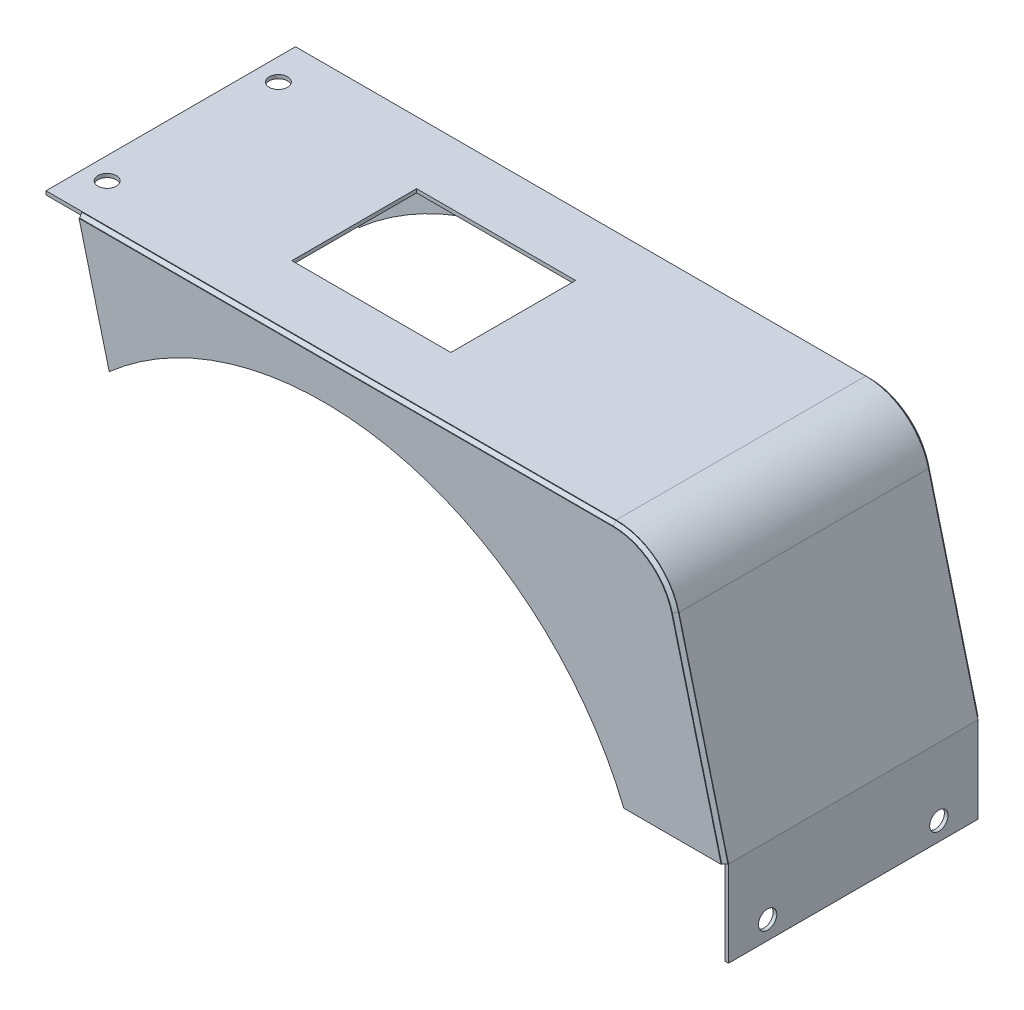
ISO-10303-21;
HEADER;
FILE_DESCRIPTION(('STEP AP214'),'2;1');
FILE_NAME('part.step','',(''),(''),'','','');
FILE_SCHEMA(('AUTOMOTIVE_DESIGN { 1 0 10303 214 1 1 1 1 }'));
ENDSEC;
DATA;
#1=APPLICATION_CONTEXT('core data for automotive mechanical design processes');
#2=APPLICATION_PROTOCOL_DEFINITION('international standard','automotive_design',2000,#1);
#3=PRODUCT_CONTEXT('',#1,'mechanical');
#4=PRODUCT('Part','Part','',(#3));
#5=PRODUCT_RELATED_PRODUCT_CATEGORY('part','',(#4));
#6=PRODUCT_DEFINITION_FORMATION('','',#4);
#7=PRODUCT_DEFINITION_CONTEXT('part definition',#1,'design');
#8=PRODUCT_DEFINITION('design','',#6,#7);
#9=PRODUCT_DEFINITION_SHAPE('','',#8);
#10=(LENGTH_UNIT() NAMED_UNIT(*) SI_UNIT(.MILLI.,.METRE.));
#11=(NAMED_UNIT(*) PLANE_ANGLE_UNIT() SI_UNIT($,.RADIAN.));
#12=(NAMED_UNIT(*) SI_UNIT($,.STERADIAN.) SOLID_ANGLE_UNIT());
#13=UNCERTAINTY_MEASURE_WITH_UNIT(LENGTH_MEASURE(1.E-05),#10,'distance_accuracy_value','');
#14=(GEOMETRIC_REPRESENTATION_CONTEXT(3) GLOBAL_UNCERTAINTY_ASSIGNED_CONTEXT((#13)) GLOBAL_UNIT_ASSIGNED_CONTEXT((#10,
#11,#12)) REPRESENTATION_CONTEXT('',''));
#15=CARTESIAN_POINT('',(0.,0.,0.));
#16=DIRECTION('',(0.,0.,1.));
#17=DIRECTION('',(1.,0.,0.));
#18=AXIS2_PLACEMENT_3D('',#15,#16,#17);
#19=CARTESIAN_POINT('',(-427.592846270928,52.5377980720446,207.));
#20=DIRECTION('',(0.968663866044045,0.248375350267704,0.));
#21=DIRECTION('',(-0.248375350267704,0.968663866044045,0.));
#22=AXIS2_PLACEMENT_3D('',#19,#20,#21);
#23=PLANE('',#22);
#24=DIRECTION('',(0.,0.,-1.));
#25=VECTOR('',#24,1.);
#26=CARTESIAN_POINT('',(-427.592846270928,52.5377980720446,207.));
#27=LINE('',#26,#25);
#28=CARTESIAN_POINT('',(-427.592846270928,52.5377980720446,206.5));
#29=VERTEX_POINT('',#28);
#30=CARTESIAN_POINT('',(-427.592846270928,52.5377980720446,204.));
#31=VERTEX_POINT('',#30);
#32=EDGE_CURVE('E94',#29,#31,#27,.T.);
#33=ORIENTED_EDGE('',*,*,#32,.F.);
#34=DIRECTION('',(0.178400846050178,-0.695763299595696,0.695763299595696));
#35=VECTOR('',#34,1.);
#36=CARTESIAN_POINT('',(-427.530783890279,52.2957547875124,206.742043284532));
#37=LINE('',#36,#35);
#38=CARTESIAN_POINT('',(-428.233871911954,55.0377980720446,204.));
#39=VERTEX_POINT('',#38);
#40=EDGE_CURVE('E12',#29,#39,#37,.F.);
#41=ORIENTED_EDGE('',*,*,#40,.T.);
#42=DIRECTION('',(-0.248375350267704,0.968663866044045,0.));
#43=VECTOR('',#42,1.);
#44=CARTESIAN_POINT('',(-427.592846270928,52.5377980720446,204.));
#45=LINE('',#44,#43);
#46=EDGE_CURVE('E106',#31,#39,#45,.T.);
#47=ORIENTED_EDGE('',*,*,#46,.F.);
#48=EDGE_LOOP('',(#33,#41,#47));
#49=FACE_BOUND('',#48,.T.);
#50=ADVANCED_FACE('F41',(#49),#23,.F.);
#51=CARTESIAN_POINT('',(97.4071537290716,-142.462201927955,207.));
#52=DIRECTION('',(0.,1.,0.));
#53=DIRECTION('',(-1.,0.,0.));
#54=AXIS2_PLACEMENT_3D('',#51,#52,#53);
#55=PLANE('',#54);
#56=DIRECTION('',(0.,0.,-1.));
#57=VECTOR('',#56,1.);
#58=CARTESIAN_POINT('',(97.4071537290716,-142.462201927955,207.));
#59=LINE('',#58,#57);
#60=CARTESIAN_POINT('',(97.4071537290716,-142.462201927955,206.5));
#61=VERTEX_POINT('',#60);
#62=CARTESIAN_POINT('',(97.4071537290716,-142.462201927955,204.));
#63=VERTEX_POINT('',#62);
#64=EDGE_CURVE('E56',#61,#63,#59,.T.);
#65=ORIENTED_EDGE('',*,*,#64,.T.);
#66=DIRECTION('',(-1.,0.,0.));
#67=VECTOR('',#66,1.);
#68=CARTESIAN_POINT('',(97.4071537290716,-142.462201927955,204.));
#69=LINE('',#68,#67);
#70=CARTESIAN_POINT('',(99.988028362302,-142.462201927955,204.));
#71=VERTEX_POINT('',#70);
#72=EDGE_CURVE('E123',#71,#63,#69,.T.);
#73=ORIENTED_EDGE('',*,*,#72,.F.);
#74=DIRECTION('',(0.718271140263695,0.,-0.695763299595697));
#75=VECTOR('',#74,1.);
#76=CARTESIAN_POINT('',(97.1572803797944,-142.462201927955,206.742043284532));
#77=LINE('',#76,#75);
#78=EDGE_CURVE('E49',#71,#61,#77,.F.);
#79=ORIENTED_EDGE('',*,*,#78,.T.);
#80=EDGE_LOOP('',(#65,#73,#79));
#81=FACE_BOUND('',#80,.T.);
#82=ADVANCED_FACE('F43',(#81),#55,.F.);
#83=CARTESIAN_POINT('',(-427.592846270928,52.5377980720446,206.5));
#84=DIRECTION('',(0.,0.707106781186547,0.707106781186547));
#85=DIRECTION('',(0.,-0.707106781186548,0.707106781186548));
#86=AXIS2_PLACEMENT_3D('',#83,#84,#85);
#87=PLANE('',#86);
#88=ORIENTED_EDGE('',*,*,#40,.F.);
#89=DIRECTION('',(-1.,0.,0.));
#90=VECTOR('',#89,1.);
#91=CARTESIAN_POINT('',(-427.592846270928,52.5377980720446,206.5));
#92=LINE('',#91,#90);
#93=CARTESIAN_POINT('',(8.61017388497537,52.5377980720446,206.5));
#94=VERTEX_POINT('',#93);
#95=EDGE_CURVE('E64',#94,#29,#92,.T.);
#96=ORIENTED_EDGE('',*,*,#95,.F.);
#97=DIRECTION('',(0.,-0.707106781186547,0.707106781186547));
#98=VECTOR('',#97,1.);
#99=CARTESIAN_POINT('',(8.61017388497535,55.0377980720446,204.));
#100=LINE('',#99,#98);
#101=CARTESIAN_POINT('',(8.61017388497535,55.0377980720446,204.));
#102=VERTEX_POINT('',#101);
#103=EDGE_CURVE('E138',#102,#94,#100,.T.);
#104=ORIENTED_EDGE('',*,*,#103,.F.);
#105=DIRECTION('',(1.,0.,0.));
#106=VECTOR('',#105,1.);
#107=CARTESIAN_POINT('',(8.61017388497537,55.0377980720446,204.));
#108=LINE('',#107,#106);
#109=EDGE_CURVE('E114',#39,#102,#108,.T.);
#110=ORIENTED_EDGE('',*,*,#109,.F.);
#111=EDGE_LOOP('',(#88,#96,#104,#110));
#112=FACE_BOUND('',#111,.T.);
#113=ADVANCED_FACE('F154',(#112),#87,.T.);
#114=CARTESIAN_POINT('',(8.61017388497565,2.53779807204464,206.5));
#115=DIRECTION('',(0.,0.,-1.));
#116=DIRECTION('',(-1.,0.,0.));
#117=AXIS2_PLACEMENT_3D('',#114,#115,#116);
#118=CONICAL_SURFACE('',#117,50.,0.785398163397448);
#119=ORIENTED_EDGE('',*,*,#103,.T.);
#120=CARTESIAN_POINT('',(8.61017388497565,2.53779807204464,206.5));
#121=DIRECTION('',(0.,0.,-1.));
#122=DIRECTION('',(-1.,0.,0.));
#123=AXIS2_PLACEMENT_3D('',#120,#121,#122);
#124=CIRCLE('',#123,50.);
#125=CARTESIAN_POINT('',(57.043367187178,14.9565655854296,206.5));
#126=VERTEX_POINT('',#125);
#127=EDGE_CURVE('E125',#126,#94,#124,.F.);
#128=ORIENTED_EDGE('',*,*,#127,.F.);
#129=DIRECTION('',(-0.68494878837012,-0.175627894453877,0.707106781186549));
#130=VECTOR('',#129,1.);
#131=CARTESIAN_POINT('',(59.4650268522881,15.5775039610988,204.));
#132=LINE('',#131,#130);
#133=CARTESIAN_POINT('',(59.4650268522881,15.5775039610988,204.));
#134=VERTEX_POINT('',#133);
#135=EDGE_CURVE('E110',#134,#126,#132,.T.);
#136=ORIENTED_EDGE('',*,*,#135,.F.);
#137=CARTESIAN_POINT('',(8.61017388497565,2.53779807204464,204.));
#138=DIRECTION('',(0.,0.,-1.));
#139=DIRECTION('',(-1.,0.,0.));
#140=AXIS2_PLACEMENT_3D('',#137,#138,#139);
#141=CIRCLE('',#140,52.5);
#142=EDGE_CURVE('E113',#102,#134,#141,.T.);
#143=ORIENTED_EDGE('',*,*,#142,.F.);
#144=EDGE_LOOP('',(#119,#128,#136,#143));
#145=FACE_BOUND('',#144,.T.);
#146=ADVANCED_FACE('F157',(#145),#118,.T.);
#147=CARTESIAN_POINT('',(57.043367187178,14.9565655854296,206.5));
#148=DIRECTION('',(0.684948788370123,0.175627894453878,0.707106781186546));
#149=DIRECTION('',(0.718271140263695,0.,-0.695763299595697));
#150=AXIS2_PLACEMENT_3D('',#147,#148,#149);
#151=PLANE('',#150);
#152=ORIENTED_EDGE('',*,*,#78,.F.);
#153=DIRECTION('',(0.248375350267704,-0.968663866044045,0.));
#154=VECTOR('',#153,1.);
#155=CARTESIAN_POINT('',(99.8288133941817,-141.841263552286,204.));
#156=LINE('',#155,#154);
#157=EDGE_CURVE('E116',#134,#71,#156,.T.);
#158=ORIENTED_EDGE('',*,*,#157,.F.);
#159=ORIENTED_EDGE('',*,*,#135,.T.);
#160=DIRECTION('',(-0.248375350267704,0.968663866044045,0.));
#161=VECTOR('',#160,1.);
#162=CARTESIAN_POINT('',(57.043367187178,14.9565655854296,206.5));
#163=LINE('',#162,#161);
#164=EDGE_CURVE('E118',#61,#126,#163,.T.);
#165=ORIENTED_EDGE('',*,*,#164,.F.);
#166=EDGE_LOOP('',(#152,#158,#159,#165));
#167=FACE_BOUND('',#166,.T.);
#168=ADVANCED_FACE('F134',(#167),#151,.T.);
#169=CARTESIAN_POINT('',(-427.592846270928,52.5377980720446,207.));
#170=DIRECTION('',(0.,-1.,0.));
#171=DIRECTION('',(1.,0.,0.));
#172=AXIS2_PLACEMENT_3D('',#169,#170,#171);
#173=PLANE('',#172);
#174=ORIENTED_EDGE('',*,*,#95,.T.);
#175=ORIENTED_EDGE('',*,*,#32,.T.);
#176=DIRECTION('',(-1.,0.,0.));
#177=VECTOR('',#176,1.);
#178=CARTESIAN_POINT('',(8.61017388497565,52.5377980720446,204.));
#179=LINE('',#178,#177);
#180=CARTESIAN_POINT('',(8.61017388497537,52.5377980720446,204.));
#181=VERTEX_POINT('',#180);
#182=EDGE_CURVE('E97',#181,#31,#179,.T.);
#183=ORIENTED_EDGE('',*,*,#182,.F.);
#184=DIRECTION('',(0.,0.,1.));
#185=VECTOR('',#184,1.);
#186=CARTESIAN_POINT('',(8.61017388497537,52.5377980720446,207.));
#187=LINE('',#186,#185);
#188=EDGE_CURVE('E102',#94,#181,#187,.F.);
#189=ORIENTED_EDGE('',*,*,#188,.F.);
#190=EDGE_LOOP('',(#174,#175,#183,#189));
#191=FACE_BOUND('',#190,.T.);
#192=ADVANCED_FACE('F96',(#191),#173,.T.);
#193=CARTESIAN_POINT('',(8.61017388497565,2.53779807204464,204.));
#194=DIRECTION('',(0.,0.,-1.));
#195=DIRECTION('',(-1.,0.,0.));
#196=AXIS2_PLACEMENT_3D('',#193,#194,#195);
#197=PLANE('',#196);
#198=ORIENTED_EDGE('',*,*,#46,.T.);
#199=ORIENTED_EDGE('',*,*,#109,.T.);
#200=ORIENTED_EDGE('',*,*,#142,.T.);
#201=ORIENTED_EDGE('',*,*,#157,.T.);
#202=ORIENTED_EDGE('',*,*,#72,.T.);
#203=DIRECTION('',(-0.248375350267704,0.968663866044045,0.));
#204=VECTOR('',#203,1.);
#205=CARTESIAN_POINT('',(57.0433671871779,14.9565655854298,204.));
#206=LINE('',#205,#204);
#207=CARTESIAN_POINT('',(57.043367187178,14.9565655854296,204.));
#208=VERTEX_POINT('',#207);
#209=EDGE_CURVE('E146',#63,#208,#206,.T.);
#210=ORIENTED_EDGE('',*,*,#209,.T.);
#211=CARTESIAN_POINT('',(8.61017388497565,2.53779807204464,204.));
#212=DIRECTION('',(0.,0.,-1.));
#213=DIRECTION('',(-1.,0.,0.));
#214=AXIS2_PLACEMENT_3D('',#211,#212,#213);
#215=CIRCLE('',#214,50.);
#216=EDGE_CURVE('E109',#208,#181,#215,.F.);
#217=ORIENTED_EDGE('',*,*,#216,.T.);
#218=ORIENTED_EDGE('',*,*,#182,.T.);
#219=EDGE_LOOP('',(#198,#199,#200,#201,#202,#210,#217,#218));
#220=FACE_BOUND('',#219,.T.);
#221=ADVANCED_FACE('F105',(#220),#197,.T.);
#222=CARTESIAN_POINT('',(8.61017388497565,2.53779807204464,207.));
#223=DIRECTION('',(0.,0.,-1.));
#224=DIRECTION('',(-1.,0.,0.));
#225=AXIS2_PLACEMENT_3D('',#222,#223,#224);
#226=CYLINDRICAL_SURFACE('',#225,50.);
#227=ORIENTED_EDGE('',*,*,#127,.T.);
#228=ORIENTED_EDGE('',*,*,#188,.T.);
#229=ORIENTED_EDGE('',*,*,#216,.F.);
#230=DIRECTION('',(0.,0.,-1.));
#231=VECTOR('',#230,1.);
#232=CARTESIAN_POINT('',(57.043367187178,14.9565655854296,207.));
#233=LINE('',#232,#231);
#234=EDGE_CURVE('E143',#126,#208,#233,.T.);
#235=ORIENTED_EDGE('',*,*,#234,.F.);
#236=EDGE_LOOP('',(#227,#228,#229,#235));
#237=FACE_BOUND('',#236,.T.);
#238=ADVANCED_FACE('F151',(#237),#226,.F.);
#239=CARTESIAN_POINT('',(57.043367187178,14.9565655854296,207.));
#240=DIRECTION('',(-0.968663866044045,-0.248375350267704,0.));
#241=DIRECTION('',(0.248375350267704,-0.968663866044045,0.));
#242=AXIS2_PLACEMENT_3D('',#239,#240,#241);
#243=PLANE('',#242);
#244=ORIENTED_EDGE('',*,*,#164,.T.);
#245=ORIENTED_EDGE('',*,*,#234,.T.);
#246=ORIENTED_EDGE('',*,*,#209,.F.);
#247=ORIENTED_EDGE('',*,*,#64,.F.);
#248=EDGE_LOOP('',(#244,#245,#246,#247));
#249=FACE_BOUND('',#248,.T.);
#250=ADVANCED_FACE('F149',(#249),#243,.T.);
#251=CLOSED_SHELL('',(#50,#82,#113,#146,#168,#192,#221,#238,#250));
#252=MANIFOLD_SOLID_BREP('B2',#251);
#253=CARTESIAN_POINT('',(97.4071537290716,-142.462201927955,-3.));
#254=DIRECTION('',(0.,1.,0.));
#255=DIRECTION('',(-1.,0.,0.));
#256=AXIS2_PLACEMENT_3D('',#253,#254,#255);
#257=PLANE('',#256);
#258=DIRECTION('',(0.,0.,1.));
#259=VECTOR('',#258,1.);
#260=CARTESIAN_POINT('',(97.4071537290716,-142.462201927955,-3.));
#261=LINE('',#260,#259);
#262=CARTESIAN_POINT('',(97.4071537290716,-142.462201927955,-2.49999999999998));
#263=VERTEX_POINT('',#262);
#264=CARTESIAN_POINT('',(97.4071537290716,-142.462201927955,0.));
#265=VERTEX_POINT('',#264);
#266=EDGE_CURVE('E293',#263,#265,#261,.T.);
#267=ORIENTED_EDGE('',*,*,#266,.F.);
#268=DIRECTION('',(0.718271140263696,0.,0.695763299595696));
#269=VECTOR('',#268,1.);
#270=CARTESIAN_POINT('',(97.1572803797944,-142.462201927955,-2.74204328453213));
#271=LINE('',#270,#269);
#272=CARTESIAN_POINT('',(99.988028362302,-142.462201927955,0.));
#273=VERTEX_POINT('',#272);
#274=EDGE_CURVE('E39',#263,#273,#271,.T.);
#275=ORIENTED_EDGE('',*,*,#274,.T.);
#276=DIRECTION('',(1.,0.,0.));
#277=VECTOR('',#276,1.);
#278=CARTESIAN_POINT('',(8.61017388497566,-142.462201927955,0.));
#279=LINE('',#278,#277);
#280=EDGE_CURVE('E305',#265,#273,#279,.T.);
#281=ORIENTED_EDGE('',*,*,#280,.F.);
#282=EDGE_LOOP('',(#267,#275,#281));
#283=FACE_BOUND('',#282,.T.);
#284=ADVANCED_FACE('F240',(#283),#257,.F.);
#285=CARTESIAN_POINT('',(-427.592846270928,52.5377980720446,-3.));
#286=DIRECTION('',(0.968663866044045,0.248375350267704,0.));
#287=DIRECTION('',(-0.248375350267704,0.968663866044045,0.));
#288=AXIS2_PLACEMENT_3D('',#285,#286,#287);
#289=PLANE('',#288);
#290=DIRECTION('',(0.,0.,1.));
#291=VECTOR('',#290,1.);
#292=CARTESIAN_POINT('',(-427.592846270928,52.5377980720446,-3.));
#293=LINE('',#292,#291);
#294=CARTESIAN_POINT('',(-427.592846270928,52.5377980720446,-2.49999999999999));
#295=VERTEX_POINT('',#294);
#296=CARTESIAN_POINT('',(-427.592846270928,52.5377980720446,0.));
#297=VERTEX_POINT('',#296);
#298=EDGE_CURVE('E255',#295,#297,#293,.T.);
#299=ORIENTED_EDGE('',*,*,#298,.T.);
#300=DIRECTION('',(0.248375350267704,-0.968663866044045,0.));
#301=VECTOR('',#300,1.);
#302=CARTESIAN_POINT('',(-388.653733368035,-99.32474224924,0.));
#303=LINE('',#302,#301);
#304=CARTESIAN_POINT('',(-428.233871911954,55.0377980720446,0.));
#305=VERTEX_POINT('',#304);
#306=EDGE_CURVE('E321',#305,#297,#303,.T.);
#307=ORIENTED_EDGE('',*,*,#306,.F.);
#308=DIRECTION('',(0.178400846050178,-0.695763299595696,-0.695763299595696));
#309=VECTOR('',#308,1.);
#310=CARTESIAN_POINT('',(-427.530783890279,52.2957547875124,-2.74204328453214));
#311=LINE('',#310,#309);
#312=EDGE_CURVE('E248',#305,#295,#311,.T.);
#313=ORIENTED_EDGE('',*,*,#312,.T.);
#314=EDGE_LOOP('',(#299,#307,#313));
#315=FACE_BOUND('',#314,.T.);
#316=ADVANCED_FACE('F242',(#315),#289,.F.);
#317=CARTESIAN_POINT('',(59.465026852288,15.5775039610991,0.));
#318=DIRECTION('',(-0.684948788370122,-0.175627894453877,0.707106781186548));
#319=DIRECTION('',(0.718271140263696,0.,0.695763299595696));
#320=AXIS2_PLACEMENT_3D('',#317,#318,#319);
#321=PLANE('',#320);
#322=ORIENTED_EDGE('',*,*,#274,.F.);
#323=DIRECTION('',(0.248375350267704,-0.968663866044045,0.));
#324=VECTOR('',#323,1.);
#325=CARTESIAN_POINT('',(97.4071537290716,-142.462201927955,-2.49999999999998));
#326=LINE('',#325,#324);
#327=CARTESIAN_POINT('',(57.0433671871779,14.9565655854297,-2.49999999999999));
#328=VERTEX_POINT('',#327);
#329=EDGE_CURVE('E263',#328,#263,#326,.T.);
#330=ORIENTED_EDGE('',*,*,#329,.F.);
#331=DIRECTION('',(-0.684948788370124,-0.175627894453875,-0.707106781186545));
#332=VECTOR('',#331,1.);
#333=CARTESIAN_POINT('',(59.465026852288,15.5775039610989,0.));
#334=LINE('',#333,#332);
#335=CARTESIAN_POINT('',(59.465026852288,15.5775039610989,0.));
#336=VERTEX_POINT('',#335);
#337=EDGE_CURVE('E316',#336,#328,#334,.T.);
#338=ORIENTED_EDGE('',*,*,#337,.F.);
#339=DIRECTION('',(-0.248375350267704,0.968663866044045,0.));
#340=VECTOR('',#339,1.);
#341=CARTESIAN_POINT('',(59.465026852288,15.5775039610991,0.));
#342=LINE('',#341,#340);
#343=EDGE_CURVE('E312',#273,#336,#342,.T.);
#344=ORIENTED_EDGE('',*,*,#343,.F.);
#345=EDGE_LOOP('',(#322,#330,#338,#344));
#346=FACE_BOUND('',#345,.T.);
#347=ADVANCED_FACE('F356',(#346),#321,.F.);
#348=CARTESIAN_POINT('',(8.61017388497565,2.53779807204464,0.));
#349=DIRECTION('',(0.,0.,1.));
#350=DIRECTION('',(1.,0.,0.));
#351=AXIS2_PLACEMENT_3D('',#348,#349,#350);
#352=CONICAL_SURFACE('',#351,52.5,0.785398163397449);
#353=ORIENTED_EDGE('',*,*,#337,.T.);
#354=CARTESIAN_POINT('',(8.61017388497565,2.53779807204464,-2.49999999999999));
#355=DIRECTION('',(0.,0.,-1.));
#356=DIRECTION('',(-1.,0.,0.));
#357=AXIS2_PLACEMENT_3D('',#354,#355,#356);
#358=CIRCLE('',#357,50.);
#359=CARTESIAN_POINT('',(8.61017388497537,52.5377980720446,-2.5));
#360=VERTEX_POINT('',#359);
#361=EDGE_CURVE('E325',#360,#328,#358,.T.);
#362=ORIENTED_EDGE('',*,*,#361,.F.);
#363=DIRECTION('',(0.,-0.707106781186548,-0.707106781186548));
#364=VECTOR('',#363,1.);
#365=CARTESIAN_POINT('',(8.61017388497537,55.0377980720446,0.));
#366=LINE('',#365,#364);
#367=CARTESIAN_POINT('',(8.61017388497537,55.0377980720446,0.));
#368=VERTEX_POINT('',#367);
#369=EDGE_CURVE('E336',#368,#360,#366,.T.);
#370=ORIENTED_EDGE('',*,*,#369,.F.);
#371=CARTESIAN_POINT('',(8.61017388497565,2.53779807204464,0.));
#372=DIRECTION('',(0.,0.,-1.));
#373=DIRECTION('',(-1.,0.,0.));
#374=AXIS2_PLACEMENT_3D('',#371,#372,#373);
#375=CIRCLE('',#374,52.5);
#376=EDGE_CURVE('E311',#336,#368,#375,.F.);
#377=ORIENTED_EDGE('',*,*,#376,.F.);
#378=EDGE_LOOP('',(#353,#362,#370,#377));
#379=FACE_BOUND('',#378,.T.);
#380=ADVANCED_FACE('F346',(#379),#352,.T.);
#381=CARTESIAN_POINT('',(8.61017388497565,55.0377980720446,0.));
#382=DIRECTION('',(0.,-0.707106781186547,0.707106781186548));
#383=DIRECTION('',(0.,-0.707106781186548,-0.707106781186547));
#384=AXIS2_PLACEMENT_3D('',#381,#382,#383);
#385=PLANE('',#384);
#386=ORIENTED_EDGE('',*,*,#369,.T.);
#387=DIRECTION('',(1.,0.,0.));
#388=VECTOR('',#387,1.);
#389=CARTESIAN_POINT('',(8.61017388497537,52.5377980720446,-2.49999999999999));
#390=LINE('',#389,#388);
#391=EDGE_CURVE('E323',#295,#360,#390,.T.);
#392=ORIENTED_EDGE('',*,*,#391,.F.);
#393=ORIENTED_EDGE('',*,*,#312,.F.);
#394=DIRECTION('',(-1.,0.,0.));
#395=VECTOR('',#394,1.);
#396=CARTESIAN_POINT('',(8.61017388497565,55.0377980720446,0.));
#397=LINE('',#396,#395);
#398=EDGE_CURVE('E314',#368,#305,#397,.T.);
#399=ORIENTED_EDGE('',*,*,#398,.F.);
#400=EDGE_LOOP('',(#386,#392,#393,#399));
#401=FACE_BOUND('',#400,.T.);
#402=ADVANCED_FACE('F334',(#401),#385,.F.);
#403=CARTESIAN_POINT('',(97.4071537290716,-142.462201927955,-3.));
#404=DIRECTION('',(-0.968663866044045,-0.248375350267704,0.));
#405=DIRECTION('',(0.248375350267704,-0.968663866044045,0.));
#406=AXIS2_PLACEMENT_3D('',#403,#404,#405);
#407=PLANE('',#406);
#408=ORIENTED_EDGE('',*,*,#329,.T.);
#409=ORIENTED_EDGE('',*,*,#266,.T.);
#410=DIRECTION('',(-0.248375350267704,0.968663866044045,0.));
#411=VECTOR('',#410,1.);
#412=CARTESIAN_POINT('',(57.0433671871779,14.9565655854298,0.));
#413=LINE('',#412,#411);
#414=CARTESIAN_POINT('',(57.0433671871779,14.9565655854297,0.));
#415=VERTEX_POINT('',#414);
#416=EDGE_CURVE('E296',#265,#415,#413,.T.);
#417=ORIENTED_EDGE('',*,*,#416,.T.);
#418=DIRECTION('',(0.,0.,1.));
#419=VECTOR('',#418,1.);
#420=CARTESIAN_POINT('',(57.0433671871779,14.9565655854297,-3.));
#421=LINE('',#420,#419);
#422=EDGE_CURVE('E300',#328,#415,#421,.T.);
#423=ORIENTED_EDGE('',*,*,#422,.F.);
#424=EDGE_LOOP('',(#408,#409,#417,#423));
#425=FACE_BOUND('',#424,.T.);
#426=ADVANCED_FACE('F295',(#425),#407,.T.);
#427=CARTESIAN_POINT('',(8.61017388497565,2.53779807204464,0.));
#428=DIRECTION('',(0.,0.,-1.));
#429=DIRECTION('',(-1.,0.,0.));
#430=AXIS2_PLACEMENT_3D('',#427,#428,#429);
#431=PLANE('',#430);
#432=ORIENTED_EDGE('',*,*,#343,.T.);
#433=ORIENTED_EDGE('',*,*,#376,.T.);
#434=ORIENTED_EDGE('',*,*,#398,.T.);
#435=ORIENTED_EDGE('',*,*,#306,.T.);
#436=DIRECTION('',(-1.,0.,0.));
#437=VECTOR('',#436,1.);
#438=CARTESIAN_POINT('',(8.61017388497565,52.5377980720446,0.));
#439=LINE('',#438,#437);
#440=CARTESIAN_POINT('',(8.61017388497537,52.5377980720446,0.));
#441=VERTEX_POINT('',#440);
#442=EDGE_CURVE('E350',#441,#297,#439,.T.);
#443=ORIENTED_EDGE('',*,*,#442,.F.);
#444=CARTESIAN_POINT('',(8.61017388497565,2.53779807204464,0.));
#445=DIRECTION('',(0.,0.,-1.));
#446=DIRECTION('',(-1.,0.,0.));
#447=AXIS2_PLACEMENT_3D('',#444,#445,#446);
#448=CIRCLE('',#447,50.);
#449=EDGE_CURVE('E308',#415,#441,#448,.F.);
#450=ORIENTED_EDGE('',*,*,#449,.F.);
#451=ORIENTED_EDGE('',*,*,#416,.F.);
#452=ORIENTED_EDGE('',*,*,#280,.T.);
#453=EDGE_LOOP('',(#432,#433,#434,#435,#443,#450,#451,#452));
#454=FACE_BOUND('',#453,.T.);
#455=ADVANCED_FACE('F304',(#454),#431,.F.);
#456=CARTESIAN_POINT('',(8.61017388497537,52.5377980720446,-3.));
#457=DIRECTION('',(0.,-1.,0.));
#458=DIRECTION('',(1.,0.,0.));
#459=AXIS2_PLACEMENT_3D('',#456,#457,#458);
#460=PLANE('',#459);
#461=ORIENTED_EDGE('',*,*,#391,.T.);
#462=DIRECTION('',(0.,0.,1.));
#463=VECTOR('',#462,1.);
#464=CARTESIAN_POINT('',(8.61017388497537,52.5377980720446,-3.));
#465=LINE('',#464,#463);
#466=EDGE_CURVE('E339',#360,#441,#465,.T.);
#467=ORIENTED_EDGE('',*,*,#466,.T.);
#468=ORIENTED_EDGE('',*,*,#442,.T.);
#469=ORIENTED_EDGE('',*,*,#298,.F.);
#470=EDGE_LOOP('',(#461,#467,#468,#469));
#471=FACE_BOUND('',#470,.T.);
#472=ADVANCED_FACE('F338',(#471),#460,.T.);
#473=CARTESIAN_POINT('',(8.61017388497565,2.53779807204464,-3.));
#474=DIRECTION('',(0.,0.,1.));
#475=DIRECTION('',(1.,0.,0.));
#476=AXIS2_PLACEMENT_3D('',#473,#474,#475);
#477=CYLINDRICAL_SURFACE('',#476,50.);
#478=ORIENTED_EDGE('',*,*,#361,.T.);
#479=ORIENTED_EDGE('',*,*,#422,.T.);
#480=ORIENTED_EDGE('',*,*,#449,.T.);
#481=ORIENTED_EDGE('',*,*,#466,.F.);
#482=EDGE_LOOP('',(#478,#479,#480,#481));
#483=FACE_BOUND('',#482,.T.);
#484=ADVANCED_FACE('F342',(#483),#477,.F.);
#485=CLOSED_SHELL('',(#284,#316,#347,#380,#402,#426,#455,#472,#484));
#486=MANIFOLD_SOLID_BREP('B6',#485);
#487=CARTESIAN_POINT('',(97.4071537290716,-142.462201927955,-3.));
#488=DIRECTION('',(0.,1.,0.));
#489=DIRECTION('',(-1.,0.,0.));
#490=AXIS2_PLACEMENT_3D('',#487,#488,#489);
#491=PLANE('',#490);
#492=DIRECTION('',(-1.,0.,0.));
#493=VECTOR('',#492,1.);
#494=CARTESIAN_POINT('',(97.4071537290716,-142.462201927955,3.));
#495=LINE('',#494,#493);
#496=CARTESIAN_POINT('',(97.4071537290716,-142.462201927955,3.));
#497=VERTEX_POINT('',#496);
#498=CARTESIAN_POINT('',(17.8149775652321,-142.462201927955,3.));
#499=VERTEX_POINT('',#498);
#500=EDGE_CURVE('E537',#497,#499,#495,.T.);
#501=ORIENTED_EDGE('',*,*,#500,.T.);
#502=DIRECTION('',(0.,0.,-1.));
#503=VECTOR('',#502,1.);
#504=CARTESIAN_POINT('',(17.8149775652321,-142.462201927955,7.));
#505=LINE('',#504,#503);
#506=CARTESIAN_POINT('',(17.8149775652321,-142.462201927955,-3.));
#507=VERTEX_POINT('',#506);
#508=EDGE_CURVE('E453',#499,#507,#505,.T.);
#509=ORIENTED_EDGE('',*,*,#508,.T.);
#510=DIRECTION('',(-1.,0.,0.));
#511=VECTOR('',#510,1.);
#512=CARTESIAN_POINT('',(97.4071537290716,-142.462201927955,-3.));
#513=LINE('',#512,#511);
#514=CARTESIAN_POINT('',(97.4071537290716,-142.462201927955,-3.));
#515=VERTEX_POINT('',#514);
#516=EDGE_CURVE('E501',#515,#507,#513,.T.);
#517=ORIENTED_EDGE('',*,*,#516,.F.);
#518=DIRECTION('',(0.,0.,1.));
#519=VECTOR('',#518,1.);
#520=CARTESIAN_POINT('',(97.4071537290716,-142.462201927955,-3.));
#521=LINE('',#520,#519);
#522=EDGE_CURVE('E516',#515,#497,#521,.T.);
#523=ORIENTED_EDGE('',*,*,#522,.T.);
#524=EDGE_LOOP('',(#501,#509,#517,#523));
#525=FACE_BOUND('',#524,.T.);
#526=ADVANCED_FACE('F439',(#525),#491,.F.);
#527=CARTESIAN_POINT('',(-427.592846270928,52.5377980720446,-3.));
#528=DIRECTION('',(0.968663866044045,0.248375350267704,0.));
#529=DIRECTION('',(-0.248375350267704,0.968663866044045,0.));
#530=AXIS2_PLACEMENT_3D('',#527,#528,#529);
#531=PLANE('',#530);
#532=DIRECTION('',(-0.248375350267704,0.968663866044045,0.));
#533=VECTOR('',#532,1.);
#534=CARTESIAN_POINT('',(-427.592846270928,52.5377980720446,-3.));
#535=LINE('',#534,#533);
#536=CARTESIAN_POINT('',(-402.906075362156,-43.7406084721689,-3.));
#537=VERTEX_POINT('',#536);
#538=CARTESIAN_POINT('',(-427.592846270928,52.5377980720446,-3.));
#539=VERTEX_POINT('',#538);
#540=EDGE_CURVE('E498',#537,#539,#535,.T.);
#541=ORIENTED_EDGE('',*,*,#540,.F.);
#542=DIRECTION('',(0.,0.,-1.));
#543=VECTOR('',#542,1.);
#544=CARTESIAN_POINT('',(-402.906075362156,-43.7406084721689,7.));
#545=LINE('',#544,#543);
#546=CARTESIAN_POINT('',(-402.906075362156,-43.7406084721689,3.));
#547=VERTEX_POINT('',#546);
#548=EDGE_CURVE('E489',#537,#547,#545,.F.);
#549=ORIENTED_EDGE('',*,*,#548,.T.);
#550=DIRECTION('',(-0.248375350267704,0.968663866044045,0.));
#551=VECTOR('',#550,1.);
#552=CARTESIAN_POINT('',(-427.592846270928,52.5377980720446,3.));
#553=LINE('',#552,#551);
#554=CARTESIAN_POINT('',(-427.592846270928,52.5377980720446,3.));
#555=VERTEX_POINT('',#554);
#556=EDGE_CURVE('E532',#547,#555,#553,.T.);
#557=ORIENTED_EDGE('',*,*,#556,.T.);
#558=DIRECTION('',(0.,0.,1.));
#559=VECTOR('',#558,1.);
#560=CARTESIAN_POINT('',(-427.592846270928,52.5377980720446,-3.));
#561=LINE('',#560,#559);
#562=EDGE_CURVE('E446',#539,#555,#561,.T.);
#563=ORIENTED_EDGE('',*,*,#562,.F.);
#564=EDGE_LOOP('',(#541,#549,#557,#563));
#565=FACE_BOUND('',#564,.T.);
#566=ADVANCED_FACE('F503',(#565),#531,.F.);
#567=CARTESIAN_POINT('',(8.61017388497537,52.5377980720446,-3.));
#568=DIRECTION('',(0.,-1.,0.));
#569=DIRECTION('',(1.,0.,0.));
#570=AXIS2_PLACEMENT_3D('',#567,#568,#569);
#571=PLANE('',#570);
#572=DIRECTION('',(1.,0.,0.));
#573=VECTOR('',#572,1.);
#574=CARTESIAN_POINT('',(8.61017388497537,52.5377980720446,3.));
#575=LINE('',#574,#573);
#576=CARTESIAN_POINT('',(8.61017388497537,52.5377980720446,3.));
#577=VERTEX_POINT('',#576);
#578=EDGE_CURVE('E528',#555,#577,#575,.T.);
#579=ORIENTED_EDGE('',*,*,#578,.T.);
#580=DIRECTION('',(0.,0.,1.));
#581=VECTOR('',#580,1.);
#582=CARTESIAN_POINT('',(8.61017388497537,52.5377980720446,-3.));
#583=LINE('',#582,#581);
#584=CARTESIAN_POINT('',(8.61017388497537,52.5377980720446,-3.));
#585=VERTEX_POINT('',#584);
#586=EDGE_CURVE('E522',#585,#577,#583,.T.);
#587=ORIENTED_EDGE('',*,*,#586,.F.);
#588=DIRECTION('',(1.,0.,0.));
#589=VECTOR('',#588,1.);
#590=CARTESIAN_POINT('',(8.61017388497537,52.5377980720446,-3.));
#591=LINE('',#590,#589);
#592=EDGE_CURVE('E506',#539,#585,#591,.T.);
#593=ORIENTED_EDGE('',*,*,#592,.F.);
#594=ORIENTED_EDGE('',*,*,#562,.T.);
#595=EDGE_LOOP('',(#579,#587,#593,#594));
#596=FACE_BOUND('',#595,.T.);
#597=ADVANCED_FACE('F526',(#596),#571,.F.);
#598=CARTESIAN_POINT('',(8.61017388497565,2.53779807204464,-3.));
#599=DIRECTION('',(0.,0.,1.));
#600=DIRECTION('',(1.,0.,0.));
#601=AXIS2_PLACEMENT_3D('',#598,#599,#600);
#602=CYLINDRICAL_SURFACE('',#601,50.);
#603=CARTESIAN_POINT('',(8.61017388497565,2.53779807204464,3.));
#604=DIRECTION('',(0.,0.,-1.));
#605=DIRECTION('',(-1.,0.,0.));
#606=AXIS2_PLACEMENT_3D('',#603,#604,#605);
#607=CIRCLE('',#606,50.);
#608=CARTESIAN_POINT('',(57.043367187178,14.9565655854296,3.));
#609=VERTEX_POINT('',#608);
#610=EDGE_CURVE('E534',#577,#609,#607,.T.);
#611=ORIENTED_EDGE('',*,*,#610,.T.);
#612=DIRECTION('',(0.,0.,1.));
#613=VECTOR('',#612,1.);
#614=CARTESIAN_POINT('',(57.043367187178,14.9565655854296,-3.));
#615=LINE('',#614,#613);
#616=CARTESIAN_POINT('',(57.043367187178,14.9565655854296,-3.));
#617=VERTEX_POINT('',#616);
#618=EDGE_CURVE('E519',#617,#609,#615,.T.);
#619=ORIENTED_EDGE('',*,*,#618,.F.);
#620=CARTESIAN_POINT('',(8.61017388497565,2.53779807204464,-3.));
#621=DIRECTION('',(0.,0.,-1.));
#622=DIRECTION('',(-1.,0.,0.));
#623=AXIS2_PLACEMENT_3D('',#620,#621,#622);
#624=CIRCLE('',#623,50.);
#625=EDGE_CURVE('E508',#585,#617,#624,.T.);
#626=ORIENTED_EDGE('',*,*,#625,.F.);
#627=ORIENTED_EDGE('',*,*,#586,.T.);
#628=EDGE_LOOP('',(#611,#619,#626,#627));
#629=FACE_BOUND('',#628,.T.);
#630=ADVANCED_FACE('F554',(#629),#602,.T.);
#631=CARTESIAN_POINT('',(97.4071537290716,-142.462201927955,-3.));
#632=DIRECTION('',(-0.968663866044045,-0.248375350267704,0.));
#633=DIRECTION('',(0.248375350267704,-0.968663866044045,0.));
#634=AXIS2_PLACEMENT_3D('',#631,#632,#633);
#635=PLANE('',#634);
#636=DIRECTION('',(0.248375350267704,-0.968663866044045,0.));
#637=VECTOR('',#636,1.);
#638=CARTESIAN_POINT('',(97.4071537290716,-142.462201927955,3.));
#639=LINE('',#638,#637);
#640=EDGE_CURVE('E510',#609,#497,#639,.T.);
#641=ORIENTED_EDGE('',*,*,#640,.T.);
#642=ORIENTED_EDGE('',*,*,#522,.F.);
#643=DIRECTION('',(0.248375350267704,-0.968663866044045,0.));
#644=VECTOR('',#643,1.);
#645=CARTESIAN_POINT('',(97.4071537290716,-142.462201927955,-3.));
#646=LINE('',#645,#644);
#647=EDGE_CURVE('E460',#617,#515,#646,.T.);
#648=ORIENTED_EDGE('',*,*,#647,.F.);
#649=ORIENTED_EDGE('',*,*,#618,.T.);
#650=EDGE_LOOP('',(#641,#642,#648,#649));
#651=FACE_BOUND('',#650,.T.);
#652=ADVANCED_FACE('F541',(#651),#635,.F.);
#653=CARTESIAN_POINT('',(8.61017388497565,2.53779807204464,-3.));
#654=DIRECTION('',(0.,0.,-1.));
#655=DIRECTION('',(-1.,0.,0.));
#656=AXIS2_PLACEMENT_3D('',#653,#654,#655);
#657=PLANE('',#656);
#658=CARTESIAN_POINT('',(-227.592846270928,-242.462201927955,-3.));
#659=DIRECTION('',(0.,0.,-1.));
#660=DIRECTION('',(-1.,0.,0.));
#661=AXIS2_PLACEMENT_3D('',#658,#659,#660);
#662=CIRCLE('',#661,265.);
#663=EDGE_CURVE('E492',#537,#507,#662,.T.);
#664=ORIENTED_EDGE('',*,*,#663,.F.);
#665=ORIENTED_EDGE('',*,*,#540,.T.);
#666=ORIENTED_EDGE('',*,*,#592,.T.);
#667=ORIENTED_EDGE('',*,*,#625,.T.);
#668=ORIENTED_EDGE('',*,*,#647,.T.);
#669=ORIENTED_EDGE('',*,*,#516,.T.);
#670=EDGE_LOOP('',(#664,#665,#666,#667,#668,#669));
#671=FACE_BOUND('',#670,.T.);
#672=ADVANCED_FACE('F497',(#671),#657,.T.);
#673=CARTESIAN_POINT('',(8.61017388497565,2.53779807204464,3.));
#674=DIRECTION('',(0.,0.,-1.));
#675=DIRECTION('',(-1.,0.,0.));
#676=AXIS2_PLACEMENT_3D('',#673,#674,#675);
#677=PLANE('',#676);
#678=ORIENTED_EDGE('',*,*,#556,.F.);
#679=CARTESIAN_POINT('',(-227.592846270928,-242.462201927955,3.));
#680=DIRECTION('',(0.,0.,-1.));
#681=DIRECTION('',(-1.,0.,0.));
#682=AXIS2_PLACEMENT_3D('',#679,#680,#681);
#683=CIRCLE('',#682,265.);
#684=EDGE_CURVE('E238',#547,#499,#683,.T.);
#685=ORIENTED_EDGE('',*,*,#684,.T.);
#686=ORIENTED_EDGE('',*,*,#500,.F.);
#687=ORIENTED_EDGE('',*,*,#640,.F.);
#688=ORIENTED_EDGE('',*,*,#610,.F.);
#689=ORIENTED_EDGE('',*,*,#578,.F.);
#690=EDGE_LOOP('',(#678,#685,#686,#687,#688,#689));
#691=FACE_BOUND('',#690,.T.);
#692=ADVANCED_FACE('F531',(#691),#677,.F.);
#693=CARTESIAN_POINT('',(-227.592846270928,-242.462201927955,7.));
#694=DIRECTION('',(0.,0.,-1.));
#695=DIRECTION('',(-1.,0.,0.));
#696=AXIS2_PLACEMENT_3D('',#693,#694,#695);
#697=CYLINDRICAL_SURFACE('',#696,265.);
#698=ORIENTED_EDGE('',*,*,#684,.F.);
#699=ORIENTED_EDGE('',*,*,#548,.F.);
#700=ORIENTED_EDGE('',*,*,#663,.T.);
#701=ORIENTED_EDGE('',*,*,#508,.F.);
#702=EDGE_LOOP('',(#698,#699,#700,#701));
#703=FACE_BOUND('',#702,.T.);
#704=ADVANCED_FACE('F491',(#703),#697,.F.);
#705=CLOSED_SHELL('',(#526,#566,#597,#630,#652,#672,#692,#704));
#706=MANIFOLD_SOLID_BREP('B33',#705);
#707=CARTESIAN_POINT('',(8.61017388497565,2.53779807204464,207.));
#708=DIRECTION('',(0.,0.,-1.));
#709=DIRECTION('',(-1.,0.,0.));
#710=AXIS2_PLACEMENT_3D('',#707,#708,#709);
#711=CYLINDRICAL_SURFACE('',#710,50.);
#712=CARTESIAN_POINT('',(8.61017388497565,2.53779807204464,201.));
#713=DIRECTION('',(0.,0.,1.));
#714=DIRECTION('',(1.,0.,0.));
#715=AXIS2_PLACEMENT_3D('',#712,#713,#714);
#716=CIRCLE('',#715,50.);
#717=CARTESIAN_POINT('',(57.043367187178,14.9565655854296,201.));
#718=VERTEX_POINT('',#717);
#719=CARTESIAN_POINT('',(8.61017388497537,52.5377980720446,201.));
#720=VERTEX_POINT('',#719);
#721=EDGE_CURVE('E713',#718,#720,#716,.T.);
#722=ORIENTED_EDGE('',*,*,#721,.T.);
#723=DIRECTION('',(0.,0.,-1.));
#724=VECTOR('',#723,1.);
#725=CARTESIAN_POINT('',(8.61017388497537,52.5377980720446,207.));
#726=LINE('',#725,#724);
#727=CARTESIAN_POINT('',(8.61017388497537,52.5377980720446,207.));
#728=VERTEX_POINT('',#727);
#729=EDGE_CURVE('E630',#728,#720,#726,.T.);
#730=ORIENTED_EDGE('',*,*,#729,.F.);
#731=CARTESIAN_POINT('',(8.61017388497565,2.53779807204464,207.));
#732=DIRECTION('',(0.,0.,1.));
#733=DIRECTION('',(1.,0.,0.));
#734=AXIS2_PLACEMENT_3D('',#731,#732,#733);
#735=CIRCLE('',#734,50.);
#736=CARTESIAN_POINT('',(57.043367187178,14.9565655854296,207.));
#737=VERTEX_POINT('',#736);
#738=EDGE_CURVE('E727',#737,#728,#735,.T.);
#739=ORIENTED_EDGE('',*,*,#738,.F.);
#740=DIRECTION('',(0.,0.,-1.));
#741=VECTOR('',#740,1.);
#742=CARTESIAN_POINT('',(57.043367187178,14.9565655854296,207.));
#743=LINE('',#742,#741);
#744=EDGE_CURVE('E692',#737,#718,#743,.T.);
#745=ORIENTED_EDGE('',*,*,#744,.T.);
#746=EDGE_LOOP('',(#722,#730,#739,#745));
#747=FACE_BOUND('',#746,.T.);
#748=ADVANCED_FACE('F623',(#747),#711,.T.);
#749=CARTESIAN_POINT('',(-427.592846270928,52.5377980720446,207.));
#750=DIRECTION('',(0.,-1.,0.));
#751=DIRECTION('',(1.,0.,0.));
#752=AXIS2_PLACEMENT_3D('',#749,#750,#751);
#753=PLANE('',#752);
#754=DIRECTION('',(-1.,0.,0.));
#755=VECTOR('',#754,1.);
#756=CARTESIAN_POINT('',(-427.592846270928,52.5377980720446,201.));
#757=LINE('',#756,#755);
#758=CARTESIAN_POINT('',(-427.592846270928,52.5377980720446,201.));
#759=VERTEX_POINT('',#758);
#760=EDGE_CURVE('E709',#720,#759,#757,.T.);
#761=ORIENTED_EDGE('',*,*,#760,.T.);
#762=DIRECTION('',(0.,0.,-1.));
#763=VECTOR('',#762,1.);
#764=CARTESIAN_POINT('',(-427.592846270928,52.5377980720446,207.));
#765=LINE('',#764,#763);
#766=CARTESIAN_POINT('',(-427.592846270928,52.5377980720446,207.));
#767=VERTEX_POINT('',#766);
#768=EDGE_CURVE('E701',#767,#759,#765,.T.);
#769=ORIENTED_EDGE('',*,*,#768,.F.);
#770=DIRECTION('',(-1.,0.,0.));
#771=VECTOR('',#770,1.);
#772=CARTESIAN_POINT('',(-427.592846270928,52.5377980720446,207.));
#773=LINE('',#772,#771);
#774=EDGE_CURVE('E694',#728,#767,#773,.T.);
#775=ORIENTED_EDGE('',*,*,#774,.F.);
#776=ORIENTED_EDGE('',*,*,#729,.T.);
#777=EDGE_LOOP('',(#761,#769,#775,#776));
#778=FACE_BOUND('',#777,.T.);
#779=ADVANCED_FACE('F707',(#778),#753,.F.);
#780=CARTESIAN_POINT('',(-427.592846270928,52.5377980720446,207.));
#781=DIRECTION('',(0.968663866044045,0.248375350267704,0.));
#782=DIRECTION('',(-0.248375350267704,0.968663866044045,0.));
#783=AXIS2_PLACEMENT_3D('',#780,#781,#782);
#784=PLANE('',#783);
#785=DIRECTION('',(0.248375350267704,-0.968663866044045,0.));
#786=VECTOR('',#785,1.);
#787=CARTESIAN_POINT('',(-427.592846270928,52.5377980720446,201.));
#788=LINE('',#787,#786);
#789=CARTESIAN_POINT('',(-402.906075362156,-43.740608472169,201.));
#790=VERTEX_POINT('',#789);
#791=EDGE_CURVE('E717',#759,#790,#788,.T.);
#792=ORIENTED_EDGE('',*,*,#791,.T.);
#793=DIRECTION('',(0.,0.,1.));
#794=VECTOR('',#793,1.);
#795=CARTESIAN_POINT('',(-402.906075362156,-43.740608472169,197.));
#796=LINE('',#795,#794);
#797=CARTESIAN_POINT('',(-402.906075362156,-43.740608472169,207.));
#798=VERTEX_POINT('',#797);
#799=EDGE_CURVE('E637',#790,#798,#796,.T.);
#800=ORIENTED_EDGE('',*,*,#799,.T.);
#801=DIRECTION('',(0.248375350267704,-0.968663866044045,0.));
#802=VECTOR('',#801,1.);
#803=CARTESIAN_POINT('',(-427.592846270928,52.5377980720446,207.));
#804=LINE('',#803,#802);
#805=EDGE_CURVE('E686',#767,#798,#804,.T.);
#806=ORIENTED_EDGE('',*,*,#805,.F.);
#807=ORIENTED_EDGE('',*,*,#768,.T.);
#808=EDGE_LOOP('',(#792,#800,#806,#807));
#809=FACE_BOUND('',#808,.T.);
#810=ADVANCED_FACE('F730',(#809),#784,.F.);
#811=CARTESIAN_POINT('',(97.4071537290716,-142.462201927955,207.));
#812=DIRECTION('',(0.,1.,0.));
#813=DIRECTION('',(-1.,0.,0.));
#814=AXIS2_PLACEMENT_3D('',#811,#812,#813);
#815=PLANE('',#814);
#816=DIRECTION('',(1.,0.,0.));
#817=VECTOR('',#816,1.);
#818=CARTESIAN_POINT('',(97.4071537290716,-142.462201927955,207.));
#819=LINE('',#818,#817);
#820=CARTESIAN_POINT('',(17.8149775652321,-142.462201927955,207.));
#821=VERTEX_POINT('',#820);
#822=CARTESIAN_POINT('',(97.4071537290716,-142.462201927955,207.));
#823=VERTEX_POINT('',#822);
#824=EDGE_CURVE('E683',#821,#823,#819,.T.);
#825=ORIENTED_EDGE('',*,*,#824,.F.);
#826=DIRECTION('',(0.,0.,1.));
#827=VECTOR('',#826,1.);
#828=CARTESIAN_POINT('',(17.8149775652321,-142.462201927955,197.));
#829=LINE('',#828,#827);
#830=CARTESIAN_POINT('',(17.8149775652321,-142.462201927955,201.));
#831=VERTEX_POINT('',#830);
#832=EDGE_CURVE('E673',#821,#831,#829,.F.);
#833=ORIENTED_EDGE('',*,*,#832,.T.);
#834=DIRECTION('',(1.,0.,0.));
#835=VECTOR('',#834,1.);
#836=CARTESIAN_POINT('',(97.4071537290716,-142.462201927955,201.));
#837=LINE('',#836,#835);
#838=CARTESIAN_POINT('',(97.4071537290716,-142.462201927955,201.));
#839=VERTEX_POINT('',#838);
#840=EDGE_CURVE('E723',#831,#839,#837,.T.);
#841=ORIENTED_EDGE('',*,*,#840,.T.);
#842=DIRECTION('',(0.,0.,-1.));
#843=VECTOR('',#842,1.);
#844=CARTESIAN_POINT('',(97.4071537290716,-142.462201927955,207.));
#845=LINE('',#844,#843);
#846=EDGE_CURVE('E690',#823,#839,#845,.T.);
#847=ORIENTED_EDGE('',*,*,#846,.F.);
#848=EDGE_LOOP('',(#825,#833,#841,#847));
#849=FACE_BOUND('',#848,.T.);
#850=ADVANCED_FACE('F688',(#849),#815,.F.);
#851=CARTESIAN_POINT('',(57.043367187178,14.9565655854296,207.));
#852=DIRECTION('',(-0.968663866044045,-0.248375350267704,0.));
#853=DIRECTION('',(0.248375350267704,-0.968663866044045,0.));
#854=AXIS2_PLACEMENT_3D('',#851,#852,#853);
#855=PLANE('',#854);
#856=DIRECTION('',(-0.248375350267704,0.968663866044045,0.));
#857=VECTOR('',#856,1.);
#858=CARTESIAN_POINT('',(57.043367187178,14.9565655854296,201.));
#859=LINE('',#858,#857);
#860=EDGE_CURVE('E725',#839,#718,#859,.T.);
#861=ORIENTED_EDGE('',*,*,#860,.T.);
#862=ORIENTED_EDGE('',*,*,#744,.F.);
#863=DIRECTION('',(-0.248375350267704,0.968663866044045,0.));
#864=VECTOR('',#863,1.);
#865=CARTESIAN_POINT('',(57.043367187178,14.9565655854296,207.));
#866=LINE('',#865,#864);
#867=EDGE_CURVE('E644',#823,#737,#866,.T.);
#868=ORIENTED_EDGE('',*,*,#867,.F.);
#869=ORIENTED_EDGE('',*,*,#846,.T.);
#870=EDGE_LOOP('',(#861,#862,#868,#869));
#871=FACE_BOUND('',#870,.T.);
#872=ADVANCED_FACE('F733',(#871),#855,.F.);
#873=CARTESIAN_POINT('',(8.61017388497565,2.53779807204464,207.));
#874=DIRECTION('',(0.,0.,1.));
#875=DIRECTION('',(1.,0.,0.));
#876=AXIS2_PLACEMENT_3D('',#873,#874,#875);
#877=PLANE('',#876);
#878=CARTESIAN_POINT('',(-227.592846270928,-242.462201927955,207.));
#879=DIRECTION('',(0.,0.,1.));
#880=DIRECTION('',(1.,0.,0.));
#881=AXIS2_PLACEMENT_3D('',#878,#879,#880);
#882=CIRCLE('',#881,265.);
#883=EDGE_CURVE('E676',#821,#798,#882,.T.);
#884=ORIENTED_EDGE('',*,*,#883,.F.);
#885=ORIENTED_EDGE('',*,*,#824,.T.);
#886=ORIENTED_EDGE('',*,*,#867,.T.);
#887=ORIENTED_EDGE('',*,*,#738,.T.);
#888=ORIENTED_EDGE('',*,*,#774,.T.);
#889=ORIENTED_EDGE('',*,*,#805,.T.);
#890=EDGE_LOOP('',(#884,#885,#886,#887,#888,#889));
#891=FACE_BOUND('',#890,.T.);
#892=ADVANCED_FACE('F682',(#891),#877,.T.);
#893=CARTESIAN_POINT('',(8.61017388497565,2.53779807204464,201.));
#894=DIRECTION('',(0.,0.,1.));
#895=DIRECTION('',(1.,0.,0.));
#896=AXIS2_PLACEMENT_3D('',#893,#894,#895);
#897=PLANE('',#896);
#898=ORIENTED_EDGE('',*,*,#840,.F.);
#899=CARTESIAN_POINT('',(-227.592846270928,-242.462201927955,201.));
#900=DIRECTION('',(0.,0.,1.));
#901=DIRECTION('',(1.,0.,0.));
#902=AXIS2_PLACEMENT_3D('',#899,#900,#901);
#903=CIRCLE('',#902,265.);
#904=EDGE_CURVE('E437',#831,#790,#903,.T.);
#905=ORIENTED_EDGE('',*,*,#904,.T.);
#906=ORIENTED_EDGE('',*,*,#791,.F.);
#907=ORIENTED_EDGE('',*,*,#760,.F.);
#908=ORIENTED_EDGE('',*,*,#721,.F.);
#909=ORIENTED_EDGE('',*,*,#860,.F.);
#910=EDGE_LOOP('',(#898,#905,#906,#907,#908,#909));
#911=FACE_BOUND('',#910,.T.);
#912=ADVANCED_FACE('F731',(#911),#897,.F.);
#913=CARTESIAN_POINT('',(-227.592846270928,-242.462201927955,197.));
#914=DIRECTION('',(0.,0.,1.));
#915=DIRECTION('',(1.,0.,0.));
#916=AXIS2_PLACEMENT_3D('',#913,#914,#915);
#917=CYLINDRICAL_SURFACE('',#916,265.);
#918=ORIENTED_EDGE('',*,*,#904,.F.);
#919=ORIENTED_EDGE('',*,*,#832,.F.);
#920=ORIENTED_EDGE('',*,*,#883,.T.);
#921=ORIENTED_EDGE('',*,*,#799,.F.);
#922=EDGE_LOOP('',(#918,#919,#920,#921));
#923=FACE_BOUND('',#922,.T.);
#924=ADVANCED_FACE('F675',(#923),#917,.F.);
#925=CLOSED_SHELL('',(#748,#779,#810,#850,#872,#892,#912,#924));
#926=MANIFOLD_SOLID_BREP('B232',#925);
#927=CARTESIAN_POINT('',(-457.592846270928,55.5377980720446,204.));
#928=DIRECTION('',(1.,0.,0.));
#929=DIRECTION('',(0.,0.,-1.));
#930=AXIS2_PLACEMENT_3D('',#927,#928,#929);
#931=PLANE('',#930);
#932=DIRECTION('',(0.,-1.,0.));
#933=VECTOR('',#932,1.);
#934=CARTESIAN_POINT('',(-457.592846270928,55.5377980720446,0.));
#935=LINE('',#934,#933);
#936=CARTESIAN_POINT('',(-457.592846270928,55.5377980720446,0.));
#937=VERTEX_POINT('',#936);
#938=CARTESIAN_POINT('',(-457.592846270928,52.5377980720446,0.));
#939=VERTEX_POINT('',#938);
#940=EDGE_CURVE('E959',#937,#939,#935,.T.);
#941=ORIENTED_EDGE('',*,*,#940,.T.);
#942=DIRECTION('',(0.,0.,-1.));
#943=VECTOR('',#942,1.);
#944=CARTESIAN_POINT('',(-457.592846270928,52.5377980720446,204.));
#945=LINE('',#944,#943);
#946=CARTESIAN_POINT('',(-457.592846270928,52.5377980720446,204.));
#947=VERTEX_POINT('',#946);
#948=EDGE_CURVE('E621',#947,#939,#945,.T.);
#949=ORIENTED_EDGE('',*,*,#948,.F.);
#950=DIRECTION('',(0.,-1.,0.));
#951=VECTOR('',#950,1.);
#952=CARTESIAN_POINT('',(-457.592846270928,55.5377980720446,204.));
#953=LINE('',#952,#951);
#954=CARTESIAN_POINT('',(-457.592846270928,55.5377980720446,204.));
#955=VERTEX_POINT('',#954);
#956=EDGE_CURVE('E980',#955,#947,#953,.T.);
#957=ORIENTED_EDGE('',*,*,#956,.F.);
#958=DIRECTION('',(0.,0.,-1.));
#959=VECTOR('',#958,1.);
#960=CARTESIAN_POINT('',(-457.592846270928,55.5377980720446,204.));
#961=LINE('',#960,#959);
#962=EDGE_CURVE('E1001',#955,#937,#961,.T.);
#963=ORIENTED_EDGE('',*,*,#962,.T.);
#964=EDGE_LOOP('',(#941,#949,#957,#963));
#965=FACE_BOUND('',#964,.T.);
#966=ADVANCED_FACE('F798',(#965),#931,.F.);
#967=CARTESIAN_POINT('',(-457.592846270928,52.5377980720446,204.));
#968=DIRECTION('',(0.,1.,0.));
#969=DIRECTION('',(-1.,0.,0.));
#970=AXIS2_PLACEMENT_3D('',#967,#968,#969);
#971=PLANE('',#970);
#972=DIRECTION('',(1.,0.,0.));
#973=VECTOR('',#972,1.);
#974=CARTESIAN_POINT('',(-457.592846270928,52.5377980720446,153.));
#975=LINE('',#974,#973);
#976=CARTESIAN_POINT('',(-307.592846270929,52.5377980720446,153.));
#977=VERTEX_POINT('',#976);
#978=CARTESIAN_POINT('',(-177.592846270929,52.5377980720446,153.));
#979=VERTEX_POINT('',#978);
#980=EDGE_CURVE('E929',#977,#979,#975,.T.);
#981=ORIENTED_EDGE('',*,*,#980,.T.);
#982=DIRECTION('',(0.,0.,-1.));
#983=VECTOR('',#982,1.);
#984=CARTESIAN_POINT('',(-177.592846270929,52.5377980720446,204.));
#985=LINE('',#984,#983);
#986=CARTESIAN_POINT('',(-177.592846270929,52.5377980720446,51.));
#987=VERTEX_POINT('',#986);
#988=EDGE_CURVE('E932',#979,#987,#985,.T.);
#989=ORIENTED_EDGE('',*,*,#988,.T.);
#990=DIRECTION('',(-1.,0.,0.));
#991=VECTOR('',#990,1.);
#992=CARTESIAN_POINT('',(-457.592846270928,52.5377980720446,51.));
#993=LINE('',#992,#991);
#994=CARTESIAN_POINT('',(-307.592846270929,52.5377980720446,51.));
#995=VERTEX_POINT('',#994);
#996=EDGE_CURVE('E924',#987,#995,#993,.T.);
#997=ORIENTED_EDGE('',*,*,#996,.T.);
#998=DIRECTION('',(0.,0.,1.));
#999=VECTOR('',#998,1.);
#1000=CARTESIAN_POINT('',(-307.592846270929,52.5377980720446,204.));
#1001=LINE('',#1000,#999);
#1002=EDGE_CURVE('E904',#995,#977,#1001,.T.);
#1003=ORIENTED_EDGE('',*,*,#1002,.T.);
#1004=EDGE_LOOP('',(#981,#989,#997,#1003));
#1005=FACE_BOUND('',#1004,.T.);
#1006=CARTESIAN_POINT('',(-439.592846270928,52.5377980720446,32.));
#1007=DIRECTION('',(0.,1.,0.));
#1008=DIRECTION('',(-1.,0.,0.));
#1009=AXIS2_PLACEMENT_3D('',#1006,#1007,#1008);
#1010=CIRCLE('',#1009,7.50000000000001);
#1011=CARTESIAN_POINT('',(-447.092846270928,52.5377980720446,32.));
#1012=VERTEX_POINT('',#1011);
#1013=EDGE_CURVE('E950',#1012,#1012,#1010,.T.);
#1014=ORIENTED_EDGE('',*,*,#1013,.T.);
#1015=EDGE_LOOP('',(#1014));
#1016=FACE_BOUND('',#1015,.T.);
#1017=CARTESIAN_POINT('',(-439.592846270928,52.5377980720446,172.));
#1018=DIRECTION('',(0.,1.,0.));
#1019=DIRECTION('',(-1.,0.,0.));
#1020=AXIS2_PLACEMENT_3D('',#1017,#1018,#1019);
#1021=CIRCLE('',#1020,7.50000000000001);
#1022=CARTESIAN_POINT('',(-447.092846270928,52.5377980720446,172.));
#1023=VERTEX_POINT('',#1022);
#1024=EDGE_CURVE('E956',#1023,#1023,#1021,.T.);
#1025=ORIENTED_EDGE('',*,*,#1024,.T.);
#1026=EDGE_LOOP('',(#1025));
#1027=FACE_BOUND('',#1026,.T.);
#1028=DIRECTION('',(1.,0.,0.));
#1029=VECTOR('',#1028,1.);
#1030=CARTESIAN_POINT('',(-457.592846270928,52.5377980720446,0.));
#1031=LINE('',#1030,#1029);
#1032=CARTESIAN_POINT('',(8.61017388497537,52.5377980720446,0.));
#1033=VERTEX_POINT('',#1032);
#1034=EDGE_CURVE('E962',#939,#1033,#1031,.T.);
#1035=ORIENTED_EDGE('',*,*,#1034,.T.);
#1036=DIRECTION('',(0.,0.,-1.));
#1037=VECTOR('',#1036,1.);
#1038=CARTESIAN_POINT('',(8.61017388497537,52.5377980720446,204.));
#1039=LINE('',#1038,#1037);
#1040=CARTESIAN_POINT('',(8.61017388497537,52.5377980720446,204.));
#1041=VERTEX_POINT('',#1040);
#1042=EDGE_CURVE('E805',#1041,#1033,#1039,.T.);
#1043=ORIENTED_EDGE('',*,*,#1042,.F.);
#1044=DIRECTION('',(1.,0.,0.));
#1045=VECTOR('',#1044,1.);
#1046=CARTESIAN_POINT('',(-457.592846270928,52.5377980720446,204.));
#1047=LINE('',#1046,#1045);
#1048=EDGE_CURVE('E983',#947,#1041,#1047,.T.);
#1049=ORIENTED_EDGE('',*,*,#1048,.F.);
#1050=ORIENTED_EDGE('',*,*,#948,.T.);
#1051=EDGE_LOOP('',(#1035,#1043,#1049,#1050));
#1052=FACE_BOUND('',#1051,.T.);
#1053=ADVANCED_FACE('F1052',(#1005,#1016,#1027,#1052),#971,.F.);
#1054=CARTESIAN_POINT('',(8.61017388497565,2.53779807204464,204.));
#1055=DIRECTION('',(0.,0.,-1.));
#1056=DIRECTION('',(-1.,0.,0.));
#1057=AXIS2_PLACEMENT_3D('',#1054,#1055,#1056);
#1058=CYLINDRICAL_SURFACE('',#1057,50.);
#1059=CARTESIAN_POINT('',(8.61017388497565,2.53779807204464,0.));
#1060=DIRECTION('',(0.,0.,-1.));
#1061=DIRECTION('',(-1.,0.,0.));
#1062=AXIS2_PLACEMENT_3D('',#1059,#1060,#1061);
#1063=CIRCLE('',#1062,50.);
#1064=CARTESIAN_POINT('',(57.043367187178,14.9565655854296,0.));
#1065=VERTEX_POINT('',#1064);
#1066=EDGE_CURVE('E964',#1033,#1065,#1063,.T.);
#1067=ORIENTED_EDGE('',*,*,#1066,.T.);
#1068=DIRECTION('',(0.,0.,-1.));
#1069=VECTOR('',#1068,1.);
#1070=CARTESIAN_POINT('',(57.043367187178,14.9565655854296,204.));
#1071=LINE('',#1070,#1069);
#1072=CARTESIAN_POINT('',(57.043367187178,14.9565655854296,204.));
#1073=VERTEX_POINT('',#1072);
#1074=EDGE_CURVE('E1022',#1073,#1065,#1071,.T.);
#1075=ORIENTED_EDGE('',*,*,#1074,.F.);
#1076=CARTESIAN_POINT('',(8.61017388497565,2.53779807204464,204.));
#1077=DIRECTION('',(0.,0.,-1.));
#1078=DIRECTION('',(-1.,0.,0.));
#1079=AXIS2_PLACEMENT_3D('',#1076,#1077,#1078);
#1080=CIRCLE('',#1079,50.);
#1081=EDGE_CURVE('E985',#1041,#1073,#1080,.T.);
#1082=ORIENTED_EDGE('',*,*,#1081,.F.);
#1083=ORIENTED_EDGE('',*,*,#1042,.T.);
#1084=EDGE_LOOP('',(#1067,#1075,#1082,#1083));
#1085=FACE_BOUND('',#1084,.T.);
#1086=ADVANCED_FACE('F1029',(#1085),#1058,.F.);
#1087=CARTESIAN_POINT('',(57.043367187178,14.9565655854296,204.));
#1088=DIRECTION('',(0.968663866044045,0.248375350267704,0.));
#1089=DIRECTION('',(-0.248375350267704,0.968663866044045,0.));
#1090=AXIS2_PLACEMENT_3D('',#1087,#1088,#1089);
#1091=PLANE('',#1090);
#1092=DIRECTION('',(0.248375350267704,-0.968663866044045,0.));
#1093=VECTOR('',#1092,1.);
#1094=CARTESIAN_POINT('',(57.043367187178,14.9565655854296,0.));
#1095=LINE('',#1094,#1093);
#1096=CARTESIAN_POINT('',(97.4071537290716,-142.462201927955,0.));
#1097=VERTEX_POINT('',#1096);
#1098=EDGE_CURVE('E966',#1065,#1097,#1095,.T.);
#1099=ORIENTED_EDGE('',*,*,#1098,.T.);
#1100=DIRECTION('',(0.,0.,-1.));
#1101=VECTOR('',#1100,1.);
#1102=CARTESIAN_POINT('',(97.4071537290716,-142.462201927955,204.));
#1103=LINE('',#1102,#1101);
#1104=CARTESIAN_POINT('',(97.4071537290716,-142.462201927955,204.));
#1105=VERTEX_POINT('',#1104);
#1106=EDGE_CURVE('E1019',#1105,#1097,#1103,.T.);
#1107=ORIENTED_EDGE('',*,*,#1106,.F.);
#1108=DIRECTION('',(0.248375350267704,-0.968663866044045,0.));
#1109=VECTOR('',#1108,1.);
#1110=CARTESIAN_POINT('',(57.043367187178,14.9565655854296,204.));
#1111=LINE('',#1110,#1109);
#1112=EDGE_CURVE('E987',#1073,#1105,#1111,.T.);
#1113=ORIENTED_EDGE('',*,*,#1112,.F.);
#1114=ORIENTED_EDGE('',*,*,#1074,.T.);
#1115=EDGE_LOOP('',(#1099,#1107,#1113,#1114));
#1116=FACE_BOUND('',#1115,.T.);
#1117=ADVANCED_FACE('F1040',(#1116),#1091,.F.);
#1118=CARTESIAN_POINT('',(97.4071537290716,-142.462201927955,204.));
#1119=DIRECTION('',(1.,0.,0.));
#1120=DIRECTION('',(0.,0.,-1.));
#1121=AXIS2_PLACEMENT_3D('',#1118,#1119,#1120);
#1122=PLANE('',#1121);
#1123=CARTESIAN_POINT('',(97.4071537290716,-197.462201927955,172.));
#1124=DIRECTION('',(1.,0.,0.));
#1125=DIRECTION('',(0.,0.,-1.));
#1126=AXIS2_PLACEMENT_3D('',#1123,#1124,#1125);
#1127=CIRCLE('',#1126,7.50000000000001);
#1128=CARTESIAN_POINT('',(97.4071537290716,-197.462201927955,164.5));
#1129=VERTEX_POINT('',#1128);
#1130=EDGE_CURVE('E938',#1129,#1129,#1127,.T.);
#1131=ORIENTED_EDGE('',*,*,#1130,.T.);
#1132=EDGE_LOOP('',(#1131));
#1133=FACE_BOUND('',#1132,.T.);
#1134=CARTESIAN_POINT('',(97.4071537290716,-197.462201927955,32.));
#1135=DIRECTION('',(1.,0.,0.));
#1136=DIRECTION('',(0.,0.,-1.));
#1137=AXIS2_PLACEMENT_3D('',#1134,#1135,#1136);
#1138=CIRCLE('',#1137,7.5);
#1139=CARTESIAN_POINT('',(97.4071537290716,-197.462201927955,24.5));
#1140=VERTEX_POINT('',#1139);
#1141=EDGE_CURVE('E944',#1140,#1140,#1138,.T.);
#1142=ORIENTED_EDGE('',*,*,#1141,.T.);
#1143=EDGE_LOOP('',(#1142));
#1144=FACE_BOUND('',#1143,.T.);
#1145=DIRECTION('',(0.,-1.,0.));
#1146=VECTOR('',#1145,1.);
#1147=CARTESIAN_POINT('',(97.4071537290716,-142.462201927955,0.));
#1148=LINE('',#1147,#1146);
#1149=CARTESIAN_POINT('',(97.4071537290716,-212.462201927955,0.));
#1150=VERTEX_POINT('',#1149);
#1151=EDGE_CURVE('E968',#1097,#1150,#1148,.T.);
#1152=ORIENTED_EDGE('',*,*,#1151,.T.);
#1153=DIRECTION('',(0.,0.,-1.));
#1154=VECTOR('',#1153,1.);
#1155=CARTESIAN_POINT('',(97.4071537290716,-212.462201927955,204.));
#1156=LINE('',#1155,#1154);
#1157=CARTESIAN_POINT('',(97.4071537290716,-212.462201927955,204.));
#1158=VERTEX_POINT('',#1157);
#1159=EDGE_CURVE('E1016',#1158,#1150,#1156,.T.);
#1160=ORIENTED_EDGE('',*,*,#1159,.F.);
#1161=DIRECTION('',(0.,-1.,0.));
#1162=VECTOR('',#1161,1.);
#1163=CARTESIAN_POINT('',(97.4071537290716,-142.462201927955,204.));
#1164=LINE('',#1163,#1162);
#1165=EDGE_CURVE('E989',#1105,#1158,#1164,.T.);
#1166=ORIENTED_EDGE('',*,*,#1165,.F.);
#1167=ORIENTED_EDGE('',*,*,#1106,.T.);
#1168=EDGE_LOOP('',(#1152,#1160,#1166,#1167));
#1169=FACE_BOUND('',#1168,.T.);
#1170=ADVANCED_FACE('F1044',(#1133,#1144,#1169),#1122,.F.);
#1171=CARTESIAN_POINT('',(97.4071537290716,-212.462201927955,204.));
#1172=DIRECTION('',(0.,1.,0.));
#1173=DIRECTION('',(0.,0.,1.));
#1174=AXIS2_PLACEMENT_3D('',#1171,#1172,#1173);
#1175=PLANE('',#1174);
#1176=DIRECTION('',(1.,0.,0.));
#1177=VECTOR('',#1176,1.);
#1178=CARTESIAN_POINT('',(97.4071537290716,-212.462201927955,0.));
#1179=LINE('',#1178,#1177);
#1180=CARTESIAN_POINT('',(100.407153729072,-212.462201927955,0.));
#1181=VERTEX_POINT('',#1180);
#1182=EDGE_CURVE('E970',#1150,#1181,#1179,.T.);
#1183=ORIENTED_EDGE('',*,*,#1182,.T.);
#1184=DIRECTION('',(0.,0.,-1.));
#1185=VECTOR('',#1184,1.);
#1186=CARTESIAN_POINT('',(100.407153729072,-212.462201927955,204.));
#1187=LINE('',#1186,#1185);
#1188=CARTESIAN_POINT('',(100.407153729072,-212.462201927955,204.));
#1189=VERTEX_POINT('',#1188);
#1190=EDGE_CURVE('E1013',#1189,#1181,#1187,.T.);
#1191=ORIENTED_EDGE('',*,*,#1190,.F.);
#1192=DIRECTION('',(1.,0.,0.));
#1193=VECTOR('',#1192,1.);
#1194=CARTESIAN_POINT('',(97.4071537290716,-212.462201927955,204.));
#1195=LINE('',#1194,#1193);
#1196=EDGE_CURVE('E991',#1158,#1189,#1195,.T.);
#1197=ORIENTED_EDGE('',*,*,#1196,.F.);
#1198=ORIENTED_EDGE('',*,*,#1159,.T.);
#1199=EDGE_LOOP('',(#1183,#1191,#1197,#1198));
#1200=FACE_BOUND('',#1199,.T.);
#1201=ADVANCED_FACE('F1074',(#1200),#1175,.F.);
#1202=CARTESIAN_POINT('',(100.407153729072,-142.083708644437,204.));
#1203=DIRECTION('',(-1.,0.,0.));
#1204=DIRECTION('',(0.,0.,1.));
#1205=AXIS2_PLACEMENT_3D('',#1202,#1203,#1204);
#1206=PLANE('',#1205);
#1207=CARTESIAN_POINT('',(100.407153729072,-197.462201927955,172.));
#1208=DIRECTION('',(1.,0.,0.));
#1209=DIRECTION('',(0.,0.,-1.));
#1210=AXIS2_PLACEMENT_3D('',#1207,#1208,#1209);
#1211=CIRCLE('',#1210,7.50000000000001);
#1212=CARTESIAN_POINT('',(100.407153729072,-197.462201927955,164.5));
#1213=VERTEX_POINT('',#1212);
#1214=EDGE_CURVE('E935',#1213,#1213,#1211,.T.);
#1215=ORIENTED_EDGE('',*,*,#1214,.F.);
#1216=EDGE_LOOP('',(#1215));
#1217=FACE_BOUND('',#1216,.T.);
#1218=CARTESIAN_POINT('',(100.407153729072,-197.462201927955,32.));
#1219=DIRECTION('',(1.,0.,0.));
#1220=DIRECTION('',(0.,0.,-1.));
#1221=AXIS2_PLACEMENT_3D('',#1218,#1219,#1220);
#1222=CIRCLE('',#1221,7.5);
#1223=CARTESIAN_POINT('',(100.407153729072,-197.462201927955,24.5));
#1224=VERTEX_POINT('',#1223);
#1225=EDGE_CURVE('E941',#1224,#1224,#1222,.T.);
#1226=ORIENTED_EDGE('',*,*,#1225,.F.);
#1227=EDGE_LOOP('',(#1226));
#1228=FACE_BOUND('',#1227,.T.);
#1229=DIRECTION('',(0.,1.,0.));
#1230=VECTOR('',#1229,1.);
#1231=CARTESIAN_POINT('',(100.407153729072,-142.083708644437,0.));
#1232=LINE('',#1231,#1230);
#1233=CARTESIAN_POINT('',(100.407153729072,-142.083708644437,0.));
#1234=VERTEX_POINT('',#1233);
#1235=EDGE_CURVE('E972',#1181,#1234,#1232,.T.);
#1236=ORIENTED_EDGE('',*,*,#1235,.T.);
#1237=DIRECTION('',(0.,0.,-1.));
#1238=VECTOR('',#1237,1.);
#1239=CARTESIAN_POINT('',(100.407153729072,-142.083708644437,204.));
#1240=LINE('',#1239,#1238);
#1241=CARTESIAN_POINT('',(100.407153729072,-142.083708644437,204.));
#1242=VERTEX_POINT('',#1241);
#1243=EDGE_CURVE('E1010',#1242,#1234,#1240,.T.);
#1244=ORIENTED_EDGE('',*,*,#1243,.F.);
#1245=DIRECTION('',(0.,1.,0.));
#1246=VECTOR('',#1245,1.);
#1247=CARTESIAN_POINT('',(100.407153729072,-142.083708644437,204.));
#1248=LINE('',#1247,#1246);
#1249=EDGE_CURVE('E993',#1189,#1242,#1248,.T.);
#1250=ORIENTED_EDGE('',*,*,#1249,.F.);
#1251=ORIENTED_EDGE('',*,*,#1190,.T.);
#1252=EDGE_LOOP('',(#1236,#1244,#1250,#1251));
#1253=FACE_BOUND('',#1252,.T.);
#1254=ADVANCED_FACE('F1071',(#1217,#1228,#1253),#1206,.F.);
#1255=CARTESIAN_POINT('',(59.9493587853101,15.7016916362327,204.));
#1256=DIRECTION('',(-0.968663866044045,-0.248375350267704,0.));
#1257=DIRECTION('',(0.248375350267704,-0.968663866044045,0.));
#1258=AXIS2_PLACEMENT_3D('',#1255,#1256,#1257);
#1259=PLANE('',#1258);
#1260=DIRECTION('',(-0.248375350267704,0.968663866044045,0.));
#1261=VECTOR('',#1260,1.);
#1262=CARTESIAN_POINT('',(59.9493587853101,15.7016916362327,0.));
#1263=LINE('',#1262,#1261);
#1264=CARTESIAN_POINT('',(59.9493587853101,15.7016916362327,0.));
#1265=VERTEX_POINT('',#1264);
#1266=EDGE_CURVE('E974',#1234,#1265,#1263,.T.);
#1267=ORIENTED_EDGE('',*,*,#1266,.T.);
#1268=DIRECTION('',(0.,0.,-1.));
#1269=VECTOR('',#1268,1.);
#1270=CARTESIAN_POINT('',(59.9493587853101,15.7016916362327,204.));
#1271=LINE('',#1270,#1269);
#1272=CARTESIAN_POINT('',(59.9493587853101,15.7016916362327,204.));
#1273=VERTEX_POINT('',#1272);
#1274=EDGE_CURVE('E1007',#1273,#1265,#1271,.T.);
#1275=ORIENTED_EDGE('',*,*,#1274,.F.);
#1276=DIRECTION('',(-0.248375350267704,0.968663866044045,0.));
#1277=VECTOR('',#1276,1.);
#1278=CARTESIAN_POINT('',(59.9493587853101,15.7016916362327,204.));
#1279=LINE('',#1278,#1277);
#1280=EDGE_CURVE('E995',#1242,#1273,#1279,.T.);
#1281=ORIENTED_EDGE('',*,*,#1280,.F.);
#1282=ORIENTED_EDGE('',*,*,#1243,.T.);
#1283=EDGE_LOOP('',(#1267,#1275,#1281,#1282));
#1284=FACE_BOUND('',#1283,.T.);
#1285=ADVANCED_FACE('F1067',(#1284),#1259,.F.);
#1286=CARTESIAN_POINT('',(8.61017388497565,2.53779807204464,204.));
#1287=DIRECTION('',(0.,0.,-1.));
#1288=DIRECTION('',(-1.,0.,0.));
#1289=AXIS2_PLACEMENT_3D('',#1286,#1287,#1288);
#1290=CYLINDRICAL_SURFACE('',#1289,53.);
#1291=CARTESIAN_POINT('',(8.61017388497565,2.53779807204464,0.));
#1292=DIRECTION('',(0.,0.,1.));
#1293=DIRECTION('',(-1.,0.,0.));
#1294=AXIS2_PLACEMENT_3D('',#1291,#1292,#1293);
#1295=CIRCLE('',#1294,53.);
#1296=CARTESIAN_POINT('',(8.61017388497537,55.5377980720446,0.));
#1297=VERTEX_POINT('',#1296);
#1298=EDGE_CURVE('E976',#1265,#1297,#1295,.T.);
#1299=ORIENTED_EDGE('',*,*,#1298,.T.);
#1300=DIRECTION('',(0.,0.,-1.));
#1301=VECTOR('',#1300,1.);
#1302=CARTESIAN_POINT('',(8.61017388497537,55.5377980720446,204.));
#1303=LINE('',#1302,#1301);
#1304=CARTESIAN_POINT('',(8.61017388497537,55.5377980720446,204.));
#1305=VERTEX_POINT('',#1304);
#1306=EDGE_CURVE('E1004',#1305,#1297,#1303,.T.);
#1307=ORIENTED_EDGE('',*,*,#1306,.F.);
#1308=CARTESIAN_POINT('',(8.61017388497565,2.53779807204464,204.));
#1309=DIRECTION('',(0.,0.,1.));
#1310=DIRECTION('',(-1.,0.,0.));
#1311=AXIS2_PLACEMENT_3D('',#1308,#1309,#1310);
#1312=CIRCLE('',#1311,53.);
#1313=EDGE_CURVE('E997',#1273,#1305,#1312,.T.);
#1314=ORIENTED_EDGE('',*,*,#1313,.F.);
#1315=ORIENTED_EDGE('',*,*,#1274,.T.);
#1316=EDGE_LOOP('',(#1299,#1307,#1314,#1315));
#1317=FACE_BOUND('',#1316,.T.);
#1318=ADVANCED_FACE('F1063',(#1317),#1290,.T.);
#1319=CARTESIAN_POINT('',(-457.592846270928,55.5377980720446,204.));
#1320=DIRECTION('',(0.,-1.,0.));
#1321=DIRECTION('',(0.,0.,-1.));
#1322=AXIS2_PLACEMENT_3D('',#1319,#1320,#1321);
#1323=PLANE('',#1322);
#1324=DIRECTION('',(-1.,0.,0.));
#1325=VECTOR('',#1324,1.);
#1326=CARTESIAN_POINT('',(-177.592846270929,55.5377980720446,51.));
#1327=LINE('',#1326,#1325);
#1328=CARTESIAN_POINT('',(-177.592846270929,55.5377980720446,51.));
#1329=VERTEX_POINT('',#1328);
#1330=CARTESIAN_POINT('',(-307.592846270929,55.5377980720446,51.));
#1331=VERTEX_POINT('',#1330);
#1332=EDGE_CURVE('E910',#1329,#1331,#1327,.T.);
#1333=ORIENTED_EDGE('',*,*,#1332,.F.);
#1334=DIRECTION('',(0.,0.,-1.));
#1335=VECTOR('',#1334,1.);
#1336=CARTESIAN_POINT('',(-177.592846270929,55.5377980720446,51.));
#1337=LINE('',#1336,#1335);
#1338=CARTESIAN_POINT('',(-177.592846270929,55.5377980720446,153.));
#1339=VERTEX_POINT('',#1338);
#1340=EDGE_CURVE('E820',#1339,#1329,#1337,.T.);
#1341=ORIENTED_EDGE('',*,*,#1340,.F.);
#1342=DIRECTION('',(1.,0.,0.));
#1343=VECTOR('',#1342,1.);
#1344=CARTESIAN_POINT('',(-177.592846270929,55.5377980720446,153.));
#1345=LINE('',#1344,#1343);
#1346=CARTESIAN_POINT('',(-307.592846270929,55.5377980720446,153.));
#1347=VERTEX_POINT('',#1346);
#1348=EDGE_CURVE('E917',#1347,#1339,#1345,.T.);
#1349=ORIENTED_EDGE('',*,*,#1348,.F.);
#1350=DIRECTION('',(0.,0.,1.));
#1351=VECTOR('',#1350,1.);
#1352=CARTESIAN_POINT('',(-307.592846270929,55.5377980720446,51.));
#1353=LINE('',#1352,#1351);
#1354=EDGE_CURVE('E901',#1331,#1347,#1353,.T.);
#1355=ORIENTED_EDGE('',*,*,#1354,.F.);
#1356=EDGE_LOOP('',(#1333,#1341,#1349,#1355));
#1357=FACE_BOUND('',#1356,.T.);
#1358=CARTESIAN_POINT('',(-439.592846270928,55.5377980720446,32.));
#1359=DIRECTION('',(0.,1.,0.));
#1360=DIRECTION('',(0.,0.,1.));
#1361=AXIS2_PLACEMENT_3D('',#1358,#1359,#1360);
#1362=CIRCLE('',#1361,7.50000000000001);
#1363=CARTESIAN_POINT('',(-439.592846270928,55.5377980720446,39.5));
#1364=VERTEX_POINT('',#1363);
#1365=EDGE_CURVE('E947',#1364,#1364,#1362,.T.);
#1366=ORIENTED_EDGE('',*,*,#1365,.F.);
#1367=EDGE_LOOP('',(#1366));
#1368=FACE_BOUND('',#1367,.T.);
#1369=CARTESIAN_POINT('',(-439.592846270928,55.5377980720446,172.));
#1370=DIRECTION('',(0.,1.,0.));
#1371=DIRECTION('',(0.,0.,1.));
#1372=AXIS2_PLACEMENT_3D('',#1369,#1370,#1371);
#1373=CIRCLE('',#1372,7.50000000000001);
#1374=CARTESIAN_POINT('',(-439.592846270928,55.5377980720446,179.5));
#1375=VERTEX_POINT('',#1374);
#1376=EDGE_CURVE('E953',#1375,#1375,#1373,.T.);
#1377=ORIENTED_EDGE('',*,*,#1376,.F.);
#1378=EDGE_LOOP('',(#1377));
#1379=FACE_BOUND('',#1378,.T.);
#1380=DIRECTION('',(-1.,0.,0.));
#1381=VECTOR('',#1380,1.);
#1382=CARTESIAN_POINT('',(-457.592846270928,55.5377980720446,0.));
#1383=LINE('',#1382,#1381);
#1384=EDGE_CURVE('E978',#1297,#937,#1383,.T.);
#1385=ORIENTED_EDGE('',*,*,#1384,.T.);
#1386=ORIENTED_EDGE('',*,*,#962,.F.);
#1387=DIRECTION('',(-1.,0.,0.));
#1388=VECTOR('',#1387,1.);
#1389=CARTESIAN_POINT('',(-457.592846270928,55.5377980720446,204.));
#1390=LINE('',#1389,#1388);
#1391=EDGE_CURVE('E999',#1305,#955,#1390,.T.);
#1392=ORIENTED_EDGE('',*,*,#1391,.F.);
#1393=ORIENTED_EDGE('',*,*,#1306,.T.);
#1394=EDGE_LOOP('',(#1385,#1386,#1392,#1393));
#1395=FACE_BOUND('',#1394,.T.);
#1396=ADVANCED_FACE('F914',(#1357,#1368,#1379,#1395),#1323,.F.);
#1397=CARTESIAN_POINT('',(8.61017388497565,2.53779807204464,204.));
#1398=DIRECTION('',(0.,0.,-1.));
#1399=DIRECTION('',(-1.,0.,0.));
#1400=AXIS2_PLACEMENT_3D('',#1397,#1398,#1399);
#1401=PLANE('',#1400);
#1402=ORIENTED_EDGE('',*,*,#956,.T.);
#1403=ORIENTED_EDGE('',*,*,#1048,.T.);
#1404=ORIENTED_EDGE('',*,*,#1081,.T.);
#1405=ORIENTED_EDGE('',*,*,#1112,.T.);
#1406=ORIENTED_EDGE('',*,*,#1165,.T.);
#1407=ORIENTED_EDGE('',*,*,#1196,.T.);
#1408=ORIENTED_EDGE('',*,*,#1249,.T.);
#1409=ORIENTED_EDGE('',*,*,#1280,.T.);
#1410=ORIENTED_EDGE('',*,*,#1313,.T.);
#1411=ORIENTED_EDGE('',*,*,#1391,.T.);
#1412=EDGE_LOOP('',(#1402,#1403,#1404,#1405,#1406,#1407,#1408,#1409,#1410,#1411));
#1413=FACE_BOUND('',#1412,.T.);
#1414=ADVANCED_FACE('F1048',(#1413),#1401,.F.);
#1415=CARTESIAN_POINT('',(8.61017388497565,2.53779807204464,0.));
#1416=DIRECTION('',(0.,0.,-1.));
#1417=DIRECTION('',(-1.,0.,0.));
#1418=AXIS2_PLACEMENT_3D('',#1415,#1416,#1417);
#1419=PLANE('',#1418);
#1420=ORIENTED_EDGE('',*,*,#940,.F.);
#1421=ORIENTED_EDGE('',*,*,#1384,.F.);
#1422=ORIENTED_EDGE('',*,*,#1298,.F.);
#1423=ORIENTED_EDGE('',*,*,#1266,.F.);
#1424=ORIENTED_EDGE('',*,*,#1235,.F.);
#1425=ORIENTED_EDGE('',*,*,#1182,.F.);
#1426=ORIENTED_EDGE('',*,*,#1151,.F.);
#1427=ORIENTED_EDGE('',*,*,#1098,.F.);
#1428=ORIENTED_EDGE('',*,*,#1066,.F.);
#1429=ORIENTED_EDGE('',*,*,#1034,.F.);
#1430=EDGE_LOOP('',(#1420,#1421,#1422,#1423,#1424,#1425,#1426,#1427,#1428,#1429));
#1431=FACE_BOUND('',#1430,.T.);
#1432=ADVANCED_FACE('F1035',(#1431),#1419,.T.);
#1433=CARTESIAN_POINT('',(-439.592846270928,49.5377980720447,172.));
#1434=DIRECTION('',(0.,1.,0.));
#1435=DIRECTION('',(0.,0.,1.));
#1436=AXIS2_PLACEMENT_3D('',#1433,#1434,#1435);
#1437=CYLINDRICAL_SURFACE('',#1436,7.50000000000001);
#1438=ORIENTED_EDGE('',*,*,#1376,.T.);
#1439=EDGE_LOOP('',(#1438));
#1440=FACE_BOUND('',#1439,.T.);
#1441=ORIENTED_EDGE('',*,*,#1024,.F.);
#1442=EDGE_LOOP('',(#1441));
#1443=FACE_BOUND('',#1442,.T.);
#1444=ADVANCED_FACE('F1199',(#1440,#1443),#1437,.F.);
#1445=CARTESIAN_POINT('',(-439.592846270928,49.5377980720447,32.));
#1446=DIRECTION('',(0.,1.,0.));
#1447=DIRECTION('',(0.,0.,1.));
#1448=AXIS2_PLACEMENT_3D('',#1445,#1446,#1447);
#1449=CYLINDRICAL_SURFACE('',#1448,7.50000000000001);
#1450=ORIENTED_EDGE('',*,*,#1365,.T.);
#1451=EDGE_LOOP('',(#1450));
#1452=FACE_BOUND('',#1451,.T.);
#1453=ORIENTED_EDGE('',*,*,#1013,.F.);
#1454=EDGE_LOOP('',(#1453));
#1455=FACE_BOUND('',#1454,.T.);
#1456=ADVANCED_FACE('F1112',(#1452,#1455),#1449,.F.);
#1457=CARTESIAN_POINT('',(97.4071537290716,-197.462201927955,32.));
#1458=DIRECTION('',(1.,0.,0.));
#1459=DIRECTION('',(0.,0.,-1.));
#1460=AXIS2_PLACEMENT_3D('',#1457,#1458,#1459);
#1461=CYLINDRICAL_SURFACE('',#1460,7.5);
#1462=ORIENTED_EDGE('',*,*,#1141,.F.);
#1463=EDGE_LOOP('',(#1462));
#1464=FACE_BOUND('',#1463,.T.);
#1465=ORIENTED_EDGE('',*,*,#1225,.T.);
#1466=EDGE_LOOP('',(#1465));
#1467=FACE_BOUND('',#1466,.T.);
#1468=ADVANCED_FACE('F1125',(#1464,#1467),#1461,.F.);
#1469=CARTESIAN_POINT('',(97.4071537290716,-197.462201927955,172.));
#1470=DIRECTION('',(1.,0.,0.));
#1471=DIRECTION('',(0.,0.,-1.));
#1472=AXIS2_PLACEMENT_3D('',#1469,#1470,#1471);
#1473=CYLINDRICAL_SURFACE('',#1472,7.50000000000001);
#1474=ORIENTED_EDGE('',*,*,#1130,.F.);
#1475=EDGE_LOOP('',(#1474));
#1476=FACE_BOUND('',#1475,.T.);
#1477=ORIENTED_EDGE('',*,*,#1214,.T.);
#1478=EDGE_LOOP('',(#1477));
#1479=FACE_BOUND('',#1478,.T.);
#1480=ADVANCED_FACE('F1130',(#1476,#1479),#1473,.F.);
#1481=CARTESIAN_POINT('',(-177.592846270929,45.5377980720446,51.));
#1482=DIRECTION('',(1.,0.,0.));
#1483=DIRECTION('',(0.,0.,-1.));
#1484=AXIS2_PLACEMENT_3D('',#1481,#1482,#1483);
#1485=PLANE('',#1484);
#1486=DIRECTION('',(0.,1.,0.));
#1487=VECTOR('',#1486,1.);
#1488=CARTESIAN_POINT('',(-177.592846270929,45.5377980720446,153.));
#1489=LINE('',#1488,#1487);
#1490=EDGE_CURVE('E922',#979,#1339,#1489,.T.);
#1491=ORIENTED_EDGE('',*,*,#1490,.T.);
#1492=ORIENTED_EDGE('',*,*,#1340,.T.);
#1493=DIRECTION('',(0.,1.,0.));
#1494=VECTOR('',#1493,1.);
#1495=CARTESIAN_POINT('',(-177.592846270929,45.5377980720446,51.));
#1496=LINE('',#1495,#1494);
#1497=EDGE_CURVE('E907',#987,#1329,#1496,.T.);
#1498=ORIENTED_EDGE('',*,*,#1497,.F.);
#1499=ORIENTED_EDGE('',*,*,#988,.F.);
#1500=EDGE_LOOP('',(#1491,#1492,#1498,#1499));
#1501=FACE_BOUND('',#1500,.T.);
#1502=ADVANCED_FACE('F1139',(#1501),#1485,.F.);
#1503=CARTESIAN_POINT('',(-177.592846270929,45.5377980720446,153.));
#1504=DIRECTION('',(0.,0.,1.));
#1505=DIRECTION('',(1.,0.,0.));
#1506=AXIS2_PLACEMENT_3D('',#1503,#1504,#1505);
#1507=PLANE('',#1506);
#1508=DIRECTION('',(0.,1.,0.));
#1509=VECTOR('',#1508,1.);
#1510=CARTESIAN_POINT('',(-307.592846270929,45.5377980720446,153.));
#1511=LINE('',#1510,#1509);
#1512=EDGE_CURVE('E906',#977,#1347,#1511,.T.);
#1513=ORIENTED_EDGE('',*,*,#1512,.T.);
#1514=ORIENTED_EDGE('',*,*,#1348,.T.);
#1515=ORIENTED_EDGE('',*,*,#1490,.F.);
#1516=ORIENTED_EDGE('',*,*,#980,.F.);
#1517=EDGE_LOOP('',(#1513,#1514,#1515,#1516));
#1518=FACE_BOUND('',#1517,.T.);
#1519=ADVANCED_FACE('F1168',(#1518),#1507,.F.);
#1520=CARTESIAN_POINT('',(-307.592846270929,45.5377980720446,51.));
#1521=DIRECTION('',(-1.,0.,0.));
#1522=DIRECTION('',(0.,0.,1.));
#1523=AXIS2_PLACEMENT_3D('',#1520,#1521,#1522);
#1524=PLANE('',#1523);
#1525=DIRECTION('',(0.,1.,0.));
#1526=VECTOR('',#1525,1.);
#1527=CARTESIAN_POINT('',(-307.592846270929,45.5377980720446,51.));
#1528=LINE('',#1527,#1526);
#1529=EDGE_CURVE('E812',#995,#1331,#1528,.T.);
#1530=ORIENTED_EDGE('',*,*,#1529,.T.);
#1531=ORIENTED_EDGE('',*,*,#1354,.T.);
#1532=ORIENTED_EDGE('',*,*,#1512,.F.);
#1533=ORIENTED_EDGE('',*,*,#1002,.F.);
#1534=EDGE_LOOP('',(#1530,#1531,#1532,#1533));
#1535=FACE_BOUND('',#1534,.T.);
#1536=ADVANCED_FACE('F898',(#1535),#1524,.F.);
#1537=CARTESIAN_POINT('',(-177.592846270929,45.5377980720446,51.));
#1538=DIRECTION('',(0.,0.,-1.));
#1539=DIRECTION('',(-1.,0.,0.));
#1540=AXIS2_PLACEMENT_3D('',#1537,#1538,#1539);
#1541=PLANE('',#1540);
#1542=ORIENTED_EDGE('',*,*,#1497,.T.);
#1543=ORIENTED_EDGE('',*,*,#1332,.T.);
#1544=ORIENTED_EDGE('',*,*,#1529,.F.);
#1545=ORIENTED_EDGE('',*,*,#996,.F.);
#1546=EDGE_LOOP('',(#1542,#1543,#1544,#1545));
#1547=FACE_BOUND('',#1546,.T.);
#1548=ADVANCED_FACE('F911',(#1547),#1541,.F.);
#1549=CLOSED_SHELL('',(#966,#1053,#1086,#1117,#1170,#1201,#1254,#1285,#1318,#1396,#1414,#1432,
#1444,#1456,#1468,#1480,#1502,#1519,#1536,#1548));
#1550=MANIFOLD_SOLID_BREP('B431',#1549);
#1551=ADVANCED_BREP_SHAPE_REPRESENTATION('',(#18,#252,#486,#706,#926,#1550),#14);
#1552=SHAPE_DEFINITION_REPRESENTATION(#9,#1551);
ENDSEC;
END-ISO-10303-21;
